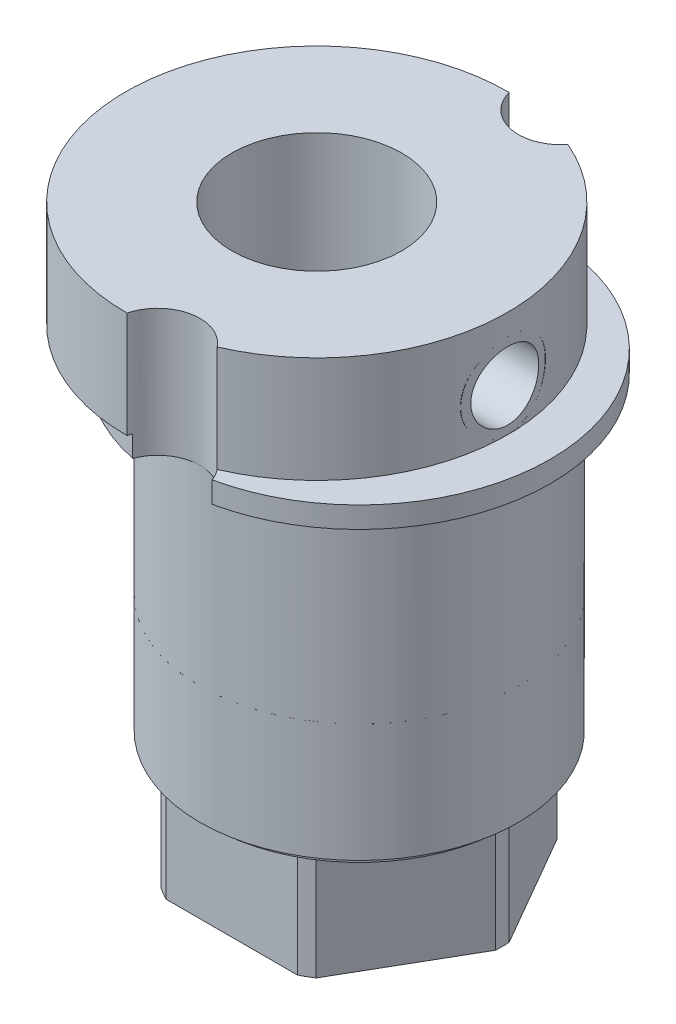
ISO-10303-21;
HEADER;
FILE_DESCRIPTION(('STEP AP214'),'2;1');
FILE_NAME('part.step','',(''),(''),'','','');
FILE_SCHEMA(('AUTOMOTIVE_DESIGN { 1 0 10303 214 1 1 1 1 }'));
ENDSEC;
DATA;
#1=APPLICATION_CONTEXT('core data for automotive mechanical design processes');
#2=APPLICATION_PROTOCOL_DEFINITION('international standard','automotive_design',2000,#1);
#3=PRODUCT_CONTEXT('',#1,'mechanical');
#4=PRODUCT('Part','Part','',(#3));
#5=PRODUCT_RELATED_PRODUCT_CATEGORY('part','',(#4));
#6=PRODUCT_DEFINITION_FORMATION('','',#4);
#7=PRODUCT_DEFINITION_CONTEXT('part definition',#1,'design');
#8=PRODUCT_DEFINITION('design','',#6,#7);
#9=PRODUCT_DEFINITION_SHAPE('','',#8);
#10=(LENGTH_UNIT() NAMED_UNIT(*) SI_UNIT(.MILLI.,.METRE.));
#11=(NAMED_UNIT(*) PLANE_ANGLE_UNIT() SI_UNIT($,.RADIAN.));
#12=(NAMED_UNIT(*) SI_UNIT($,.STERADIAN.) SOLID_ANGLE_UNIT());
#13=UNCERTAINTY_MEASURE_WITH_UNIT(LENGTH_MEASURE(1.E-05),#10,'distance_accuracy_value','');
#14=(GEOMETRIC_REPRESENTATION_CONTEXT(3) GLOBAL_UNCERTAINTY_ASSIGNED_CONTEXT((#13)) GLOBAL_UNIT_ASSIGNED_CONTEXT((#10,
#11,#12)) REPRESENTATION_CONTEXT('',''));
#15=CARTESIAN_POINT('',(0.,0.,0.));
#16=DIRECTION('',(0.,0.,1.));
#17=DIRECTION('',(1.,0.,0.));
#18=AXIS2_PLACEMENT_3D('',#15,#16,#17);
#19=CARTESIAN_POINT('',(2.,-11.05,0.));
#20=DIRECTION('',(0.,1.,0.));
#21=DIRECTION('',(0.,0.,1.));
#22=AXIS2_PLACEMENT_3D('',#19,#20,#21);
#23=CYLINDRICAL_SURFACE('',#22,6.75);
#24=CARTESIAN_POINT('',(2.,-5.,0.));
#25=DIRECTION('',(0.,1.,0.));
#26=DIRECTION('',(0.,0.,1.));
#27=AXIS2_PLACEMENT_3D('',#24,#25,#26);
#28=CIRCLE('',#27,6.75);
#29=CARTESIAN_POINT('',(-1.6499878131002,-5.,-5.67803566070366));
#30=VERTEX_POINT('',#29);
#31=CARTESIAN_POINT('',(-1.09232921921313,-5.0000000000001,-6.));
#32=VERTEX_POINT('',#31);
#33=EDGE_CURVE('P0_E200',#30,#32,#28,.F.);
#34=ORIENTED_EDGE('',*,*,#33,.T.);
#35=DIRECTION('',(0.,1.,0.));
#36=VECTOR('',#35,1.);
#37=CARTESIAN_POINT('',(-1.092329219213,-10.,-6.));
#38=LINE('',#37,#36);
#39=CARTESIAN_POINT('',(-1.09232921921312,-10.,-6.));
#40=VERTEX_POINT('',#39);
#41=EDGE_CURVE('P0_E175',#32,#40,#38,.F.);
#42=ORIENTED_EDGE('',*,*,#41,.T.);
#43=CARTESIAN_POINT('',(2.,-10.,0.));
#44=DIRECTION('',(0.,1.,0.));
#45=DIRECTION('',(0.,0.,1.));
#46=AXIS2_PLACEMENT_3D('',#43,#44,#45);
#47=CIRCLE('',#46,6.75);
#48=CARTESIAN_POINT('',(-1.64998781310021,-10.,-5.67803566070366));
#49=VERTEX_POINT('',#48);
#50=EDGE_CURVE('P0_E441',#49,#40,#47,.F.);
#51=ORIENTED_EDGE('',*,*,#50,.F.);
#52=DIRECTION('',(0.,1.,0.));
#53=VECTOR('',#52,1.);
#54=CARTESIAN_POINT('',(-1.64998781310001,-10.,-5.67803566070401));
#55=LINE('',#54,#53);
#56=EDGE_CURVE('P0_E166',#49,#30,#55,.T.);
#57=ORIENTED_EDGE('',*,*,#56,.T.);
#58=EDGE_LOOP('',(#34,#42,#51,#57));
#59=FACE_BOUND('',#58,.T.);
#60=ADVANCED_FACE('P0_F16',(#59),#23,.T.);
#61=CARTESIAN_POINT('',(2.,-11.05,0.));
#62=DIRECTION('',(0.,1.,0.));
#63=DIRECTION('',(0.,0.,1.));
#64=AXIS2_PLACEMENT_3D('',#61,#62,#63);
#65=CYLINDRICAL_SURFACE('',#64,6.75);
#66=CARTESIAN_POINT('',(2.,-5.,0.));
#67=DIRECTION('',(0.,1.,0.));
#68=DIRECTION('',(0.,0.,1.));
#69=AXIS2_PLACEMENT_3D('',#66,#67,#68);
#70=CIRCLE('',#69,6.75);
#71=CARTESIAN_POINT('',(5.09232921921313,-5.0000000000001,-6.));
#72=VERTEX_POINT('',#71);
#73=CARTESIAN_POINT('',(5.64998781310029,-5.00000000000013,-5.67803566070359));
#74=VERTEX_POINT('',#73);
#75=EDGE_CURVE('P0_E195',#72,#74,#70,.F.);
#76=ORIENTED_EDGE('',*,*,#75,.T.);
#77=DIRECTION('',(0.,1.,0.));
#78=VECTOR('',#77,1.);
#79=CARTESIAN_POINT('',(5.64998781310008,-10.,-5.67803566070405));
#80=LINE('',#79,#78);
#81=CARTESIAN_POINT('',(5.64998781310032,-10.,-5.67803566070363));
#82=VERTEX_POINT('',#81);
#83=EDGE_CURVE('P0_E158',#74,#82,#80,.F.);
#84=ORIENTED_EDGE('',*,*,#83,.T.);
#85=CARTESIAN_POINT('',(2.,-10.,0.));
#86=DIRECTION('',(0.,1.,0.));
#87=DIRECTION('',(0.,0.,1.));
#88=AXIS2_PLACEMENT_3D('',#85,#86,#87);
#89=CIRCLE('',#88,6.75);
#90=CARTESIAN_POINT('',(5.09232921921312,-10.,-6.));
#91=VERTEX_POINT('',#90);
#92=EDGE_CURVE('P0_E148',#91,#82,#89,.F.);
#93=ORIENTED_EDGE('',*,*,#92,.F.);
#94=DIRECTION('',(0.,1.,0.));
#95=VECTOR('',#94,1.);
#96=CARTESIAN_POINT('',(5.092329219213,-10.,-6.));
#97=LINE('',#96,#95);
#98=EDGE_CURVE('P0_E172',#91,#72,#97,.T.);
#99=ORIENTED_EDGE('',*,*,#98,.T.);
#100=EDGE_LOOP('',(#76,#84,#93,#99));
#101=FACE_BOUND('',#100,.T.);
#102=ADVANCED_FACE('P0_F453',(#101),#65,.T.);
#103=CARTESIAN_POINT('',(2.,-11.05,0.));
#104=DIRECTION('',(0.,1.,0.));
#105=DIRECTION('',(0.,0.,1.));
#106=AXIS2_PLACEMENT_3D('',#103,#104,#105);
#107=CYLINDRICAL_SURFACE('',#106,6.75);
#108=CARTESIAN_POINT('',(2.,-5.,0.));
#109=DIRECTION('',(0.,1.,0.));
#110=DIRECTION('',(0.,0.,1.));
#111=AXIS2_PLACEMENT_3D('',#108,#109,#110);
#112=CIRCLE('',#111,6.75);
#113=CARTESIAN_POINT('',(5.6499878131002,-5.,5.67803566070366));
#114=VERTEX_POINT('',#113);
#115=CARTESIAN_POINT('',(5.09232921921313,-5.0000000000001,6.));
#116=VERTEX_POINT('',#115);
#117=EDGE_CURVE('P0_E187',#114,#116,#112,.F.);
#118=ORIENTED_EDGE('',*,*,#117,.T.);
#119=DIRECTION('',(0.,1.,0.));
#120=VECTOR('',#119,1.);
#121=CARTESIAN_POINT('',(5.092329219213,-10.,6.));
#122=LINE('',#121,#120);
#123=CARTESIAN_POINT('',(5.09232921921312,-10.,6.));
#124=VERTEX_POINT('',#123);
#125=EDGE_CURVE('P0_E163',#116,#124,#122,.F.);
#126=ORIENTED_EDGE('',*,*,#125,.T.);
#127=CARTESIAN_POINT('',(2.,-10.,0.));
#128=DIRECTION('',(0.,1.,0.));
#129=DIRECTION('',(0.,0.,1.));
#130=AXIS2_PLACEMENT_3D('',#127,#128,#129);
#131=CIRCLE('',#130,6.75);
#132=CARTESIAN_POINT('',(5.64998781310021,-10.,5.67803566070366));
#133=VERTEX_POINT('',#132);
#134=EDGE_CURVE('P0_E142',#133,#124,#131,.F.);
#135=ORIENTED_EDGE('',*,*,#134,.F.);
#136=DIRECTION('',(0.,1.,0.));
#137=VECTOR('',#136,1.);
#138=CARTESIAN_POINT('',(5.64998781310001,-10.,5.67803566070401));
#139=LINE('',#138,#137);
#140=EDGE_CURVE('P0_E192',#133,#114,#139,.T.);
#141=ORIENTED_EDGE('',*,*,#140,.T.);
#142=EDGE_LOOP('',(#118,#126,#135,#141));
#143=FACE_BOUND('',#142,.T.);
#144=ADVANCED_FACE('P0_F427',(#143),#107,.T.);
#145=CARTESIAN_POINT('',(2.,-11.05,0.));
#146=DIRECTION('',(0.,1.,0.));
#147=DIRECTION('',(0.,0.,1.));
#148=AXIS2_PLACEMENT_3D('',#145,#146,#147);
#149=CYLINDRICAL_SURFACE('',#148,6.75);
#150=DIRECTION('',(0.,1.,0.));
#151=VECTOR('',#150,1.);
#152=CARTESIAN_POINT('',(8.7423170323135,-10.,0.321964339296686));
#153=LINE('',#152,#151);
#154=CARTESIAN_POINT('',(8.74231703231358,-5.,0.321964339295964));
#155=VERTEX_POINT('',#154);
#156=CARTESIAN_POINT('',(8.74231703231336,-10.,0.321964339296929));
#157=VERTEX_POINT('',#156);
#158=EDGE_CURVE('P0_E138',#155,#157,#153,.F.);
#159=ORIENTED_EDGE('',*,*,#158,.T.);
#160=CARTESIAN_POINT('',(2.,-10.,0.));
#161=DIRECTION('',(0.,1.,0.));
#162=DIRECTION('',(0.,0.,1.));
#163=AXIS2_PLACEMENT_3D('',#160,#161,#162);
#164=CIRCLE('',#163,6.75);
#165=CARTESIAN_POINT('',(8.74231703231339,-10.,-0.321964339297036));
#166=VERTEX_POINT('',#165);
#167=EDGE_CURVE('P0_E19',#166,#157,#164,.F.);
#168=ORIENTED_EDGE('',*,*,#167,.F.);
#169=DIRECTION('',(0.,1.,0.));
#170=VECTOR('',#169,1.);
#171=CARTESIAN_POINT('',(8.74231703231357,-10.,-0.321964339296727));
#172=LINE('',#171,#170);
#173=CARTESIAN_POINT('',(8.74231703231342,-5.00000000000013,-0.321964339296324));
#174=VERTEX_POINT('',#173);
#175=EDGE_CURVE('P0_E135',#166,#174,#172,.T.);
#176=ORIENTED_EDGE('',*,*,#175,.T.);
#177=CARTESIAN_POINT('',(2.,-5.,0.));
#178=DIRECTION('',(0.,1.,0.));
#179=DIRECTION('',(0.,0.,1.));
#180=AXIS2_PLACEMENT_3D('',#177,#178,#179);
#181=CIRCLE('',#180,6.75);
#182=EDGE_CURVE('P0_E143',#174,#155,#181,.F.);
#183=ORIENTED_EDGE('',*,*,#182,.T.);
#184=EDGE_LOOP('',(#159,#168,#176,#183));
#185=FACE_BOUND('',#184,.T.);
#186=ADVANCED_FACE('P0_F132',(#185),#149,.T.);
#187=CARTESIAN_POINT('',(0.,-10.,0.));
#188=DIRECTION('',(0.,-1.,0.));
#189=DIRECTION('',(0.,0.,-1.));
#190=AXIS2_PLACEMENT_3D('',#187,#188,#189);
#191=PLANE('',#190);
#192=CARTESIAN_POINT('',(0.,-10.,0.));
#193=DIRECTION('',(0.,-1.,0.));
#194=DIRECTION('',(0.,0.,-1.));
#195=AXIS2_PLACEMENT_3D('',#192,#193,#194);
#196=CIRCLE('',#195,4.);
#197=CARTESIAN_POINT('',(0.,-10.,-4.));
#198=VERTEX_POINT('',#197);
#199=EDGE_CURVE('P0_E160',#198,#198,#196,.F.);
#200=ORIENTED_EDGE('',*,*,#199,.T.);
#201=EDGE_LOOP('',(#200));
#202=FACE_BOUND('',#201,.T.);
#203=ORIENTED_EDGE('',*,*,#92,.T.);
#204=DIRECTION('',(0.500000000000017,0.,0.866025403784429));
#205=VECTOR('',#204,1.);
#206=CARTESIAN_POINT('',(8.928203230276,-10.,0.));
#207=LINE('',#206,#205);
#208=EDGE_CURVE('P0_E145',#82,#166,#207,.T.);
#209=ORIENTED_EDGE('',*,*,#208,.T.);
#210=ORIENTED_EDGE('',*,*,#167,.T.);
#211=DIRECTION('',(-0.500000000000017,0.,0.866025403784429));
#212=VECTOR('',#211,1.);
#213=CARTESIAN_POINT('',(5.464101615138,-10.,6.));
#214=LINE('',#213,#212);
#215=EDGE_CURVE('P0_E190',#157,#133,#214,.T.);
#216=ORIENTED_EDGE('',*,*,#215,.T.);
#217=ORIENTED_EDGE('',*,*,#134,.T.);
#218=DIRECTION('',(-1.,0.,0.));
#219=VECTOR('',#218,1.);
#220=CARTESIAN_POINT('',(-1.464101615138,-10.,6.));
#221=LINE('',#220,#219);
#222=CARTESIAN_POINT('',(-1.09232921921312,-10.,6.));
#223=VERTEX_POINT('',#222);
#224=EDGE_CURVE('P0_E196',#124,#223,#221,.T.);
#225=ORIENTED_EDGE('',*,*,#224,.T.);
#226=CARTESIAN_POINT('',(2.,-10.,0.));
#227=DIRECTION('',(0.,1.,0.));
#228=DIRECTION('',(0.,0.,1.));
#229=AXIS2_PLACEMENT_3D('',#226,#227,#228);
#230=CIRCLE('',#229,6.75);
#231=CARTESIAN_POINT('',(-1.64998781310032,-10.,5.67803566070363));
#232=VERTEX_POINT('',#231);
#233=EDGE_CURVE('P0_E182',#232,#223,#230,.T.);
#234=ORIENTED_EDGE('',*,*,#233,.F.);
#235=DIRECTION('',(-0.500000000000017,0.,-0.866025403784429));
#236=VECTOR('',#235,1.);
#237=CARTESIAN_POINT('',(-4.928203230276,-10.,0.));
#238=LINE('',#237,#236);
#239=CARTESIAN_POINT('',(-4.74231703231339,-10.,0.321964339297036));
#240=VERTEX_POINT('',#239);
#241=EDGE_CURVE('P0_E183',#232,#240,#238,.T.);
#242=ORIENTED_EDGE('',*,*,#241,.T.);
#243=CARTESIAN_POINT('',(2.,-10.,0.));
#244=DIRECTION('',(0.,1.,0.));
#245=DIRECTION('',(0.,0.,1.));
#246=AXIS2_PLACEMENT_3D('',#243,#244,#245);
#247=CIRCLE('',#246,6.75);
#248=CARTESIAN_POINT('',(-4.74231703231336,-10.,-0.321964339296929));
#249=VERTEX_POINT('',#248);
#250=EDGE_CURVE('P0_E204',#249,#240,#247,.T.);
#251=ORIENTED_EDGE('',*,*,#250,.F.);
#252=DIRECTION('',(0.500000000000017,0.,-0.866025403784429));
#253=VECTOR('',#252,1.);
#254=CARTESIAN_POINT('',(-1.464101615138,-10.,-6.));
#255=LINE('',#254,#253);
#256=EDGE_CURVE('P0_E169',#249,#49,#255,.T.);
#257=ORIENTED_EDGE('',*,*,#256,.T.);
#258=ORIENTED_EDGE('',*,*,#50,.T.);
#259=DIRECTION('',(1.,0.,0.));
#260=VECTOR('',#259,1.);
#261=CARTESIAN_POINT('',(5.464101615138,-10.,-6.));
#262=LINE('',#261,#260);
#263=EDGE_CURVE('P0_E176',#40,#91,#262,.T.);
#264=ORIENTED_EDGE('',*,*,#263,.T.);
#265=EDGE_LOOP('',(#203,#209,#210,#216,#217,#225,#234,#242,#251,#257,#258,#264));
#266=FACE_BOUND('',#265,.T.);
#267=ADVANCED_FACE('P0_F146',(#202,#266),#191,.T.);
#268=CARTESIAN_POINT('',(2.,-11.05,0.));
#269=DIRECTION('',(0.,1.,0.));
#270=DIRECTION('',(0.,0.,1.));
#271=AXIS2_PLACEMENT_3D('',#268,#269,#270);
#272=CYLINDRICAL_SURFACE('',#271,6.75);
#273=DIRECTION('',(0.,1.,0.));
#274=VECTOR('',#273,1.);
#275=CARTESIAN_POINT('',(-4.74231703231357,-10.,0.321964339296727));
#276=LINE('',#275,#274);
#277=CARTESIAN_POINT('',(-4.74231703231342,-5.00000000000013,0.321964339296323));
#278=VERTEX_POINT('',#277);
#279=EDGE_CURVE('P0_E185',#240,#278,#276,.T.);
#280=ORIENTED_EDGE('',*,*,#279,.T.);
#281=CARTESIAN_POINT('',(2.,-5.,0.));
#282=DIRECTION('',(0.,1.,0.));
#283=DIRECTION('',(0.,0.,1.));
#284=AXIS2_PLACEMENT_3D('',#281,#282,#283);
#285=CIRCLE('',#284,6.75);
#286=CARTESIAN_POINT('',(-4.74231703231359,-5.,-0.321964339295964));
#287=VERTEX_POINT('',#286);
#288=EDGE_CURVE('P0_E202',#278,#287,#285,.F.);
#289=ORIENTED_EDGE('',*,*,#288,.T.);
#290=DIRECTION('',(0.,1.,0.));
#291=VECTOR('',#290,1.);
#292=CARTESIAN_POINT('',(-4.7423170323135,-10.,-0.321964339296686));
#293=LINE('',#292,#291);
#294=EDGE_CURVE('P0_E152',#287,#249,#293,.F.);
#295=ORIENTED_EDGE('',*,*,#294,.T.);
#296=ORIENTED_EDGE('',*,*,#250,.T.);
#297=EDGE_LOOP('',(#280,#289,#295,#296));
#298=FACE_BOUND('',#297,.T.);
#299=ADVANCED_FACE('P0_F499',(#298),#272,.T.);
#300=CARTESIAN_POINT('',(2.,-11.05,0.));
#301=DIRECTION('',(0.,1.,0.));
#302=DIRECTION('',(0.,0.,1.));
#303=AXIS2_PLACEMENT_3D('',#300,#301,#302);
#304=CYLINDRICAL_SURFACE('',#303,6.75);
#305=CARTESIAN_POINT('',(2.,-5.,0.));
#306=DIRECTION('',(0.,1.,0.));
#307=DIRECTION('',(0.,0.,1.));
#308=AXIS2_PLACEMENT_3D('',#305,#306,#307);
#309=CIRCLE('',#308,6.75);
#310=CARTESIAN_POINT('',(-1.09232921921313,-5.0000000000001,6.));
#311=VERTEX_POINT('',#310);
#312=CARTESIAN_POINT('',(-1.64998781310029,-5.00000000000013,5.67803566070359));
#313=VERTEX_POINT('',#312);
#314=EDGE_CURVE('P0_E179',#311,#313,#309,.F.);
#315=ORIENTED_EDGE('',*,*,#314,.T.);
#316=DIRECTION('',(0.,1.,0.));
#317=VECTOR('',#316,1.);
#318=CARTESIAN_POINT('',(-1.64998781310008,-10.,5.67803566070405));
#319=LINE('',#318,#317);
#320=EDGE_CURVE('P0_E410',#313,#232,#319,.F.);
#321=ORIENTED_EDGE('',*,*,#320,.T.);
#322=ORIENTED_EDGE('',*,*,#233,.T.);
#323=DIRECTION('',(0.,1.,0.));
#324=VECTOR('',#323,1.);
#325=CARTESIAN_POINT('',(-1.092329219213,-10.,6.));
#326=LINE('',#325,#324);
#327=EDGE_CURVE('P0_E198',#223,#311,#326,.T.);
#328=ORIENTED_EDGE('',*,*,#327,.T.);
#329=EDGE_LOOP('',(#315,#321,#322,#328));
#330=FACE_BOUND('',#329,.T.);
#331=ADVANCED_FACE('P0_F431',(#330),#304,.T.);
#332=CARTESIAN_POINT('',(5.464101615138,-10.,-6.));
#333=DIRECTION('',(0.,0.,1.));
#334=DIRECTION('',(1.,0.,0.));
#335=AXIS2_PLACEMENT_3D('',#332,#333,#334);
#336=PLANE('',#335);
#337=DIRECTION('',(1.,0.,0.));
#338=VECTOR('',#337,1.);
#339=CARTESIAN_POINT('',(0.,-5.,-6.));
#340=LINE('',#339,#338);
#341=EDGE_CURVE('P0_E407',#72,#32,#340,.F.);
#342=ORIENTED_EDGE('',*,*,#341,.F.);
#343=ORIENTED_EDGE('',*,*,#98,.F.);
#344=ORIENTED_EDGE('',*,*,#263,.F.);
#345=ORIENTED_EDGE('',*,*,#41,.F.);
#346=EDGE_LOOP('',(#342,#343,#344,#345));
#347=FACE_BOUND('',#346,.T.);
#348=ADVANCED_FACE('P0_F450',(#347),#336,.F.);
#349=CARTESIAN_POINT('',(-1.464101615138,-10.,-6.));
#350=DIRECTION('',(0.866025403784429,0.,0.500000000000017));
#351=DIRECTION('',(0.500000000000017,0.,-0.866025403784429));
#352=AXIS2_PLACEMENT_3D('',#349,#350,#351);
#353=PLANE('',#352);
#354=DIRECTION('',(-0.499999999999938,0.,0.866025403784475));
#355=VECTOR('',#354,1.);
#356=CARTESIAN_POINT('',(-1.6499878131,-5.,-5.678035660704));
#357=LINE('',#356,#355);
#358=EDGE_CURVE('P0_E404',#30,#287,#357,.T.);
#359=ORIENTED_EDGE('',*,*,#358,.F.);
#360=ORIENTED_EDGE('',*,*,#56,.F.);
#361=ORIENTED_EDGE('',*,*,#256,.F.);
#362=ORIENTED_EDGE('',*,*,#294,.F.);
#363=EDGE_LOOP('',(#359,#360,#361,#362));
#364=FACE_BOUND('',#363,.T.);
#365=ADVANCED_FACE('P0_F503',(#364),#353,.F.);
#366=CARTESIAN_POINT('',(8.928203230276,-10.,0.));
#367=DIRECTION('',(-0.866025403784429,0.,0.500000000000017));
#368=DIRECTION('',(0.500000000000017,0.,0.866025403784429));
#369=AXIS2_PLACEMENT_3D('',#366,#367,#368);
#370=PLANE('',#369);
#371=DIRECTION('',(-0.499999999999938,0.,-0.866025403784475));
#372=VECTOR('',#371,1.);
#373=CARTESIAN_POINT('',(8.742317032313,-5.,-0.3219643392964));
#374=LINE('',#373,#372);
#375=EDGE_CURVE('P0_E156',#174,#74,#374,.T.);
#376=ORIENTED_EDGE('',*,*,#375,.F.);
#377=ORIENTED_EDGE('',*,*,#175,.F.);
#378=ORIENTED_EDGE('',*,*,#208,.F.);
#379=ORIENTED_EDGE('',*,*,#83,.F.);
#380=EDGE_LOOP('',(#376,#377,#378,#379));
#381=FACE_BOUND('',#380,.T.);
#382=ADVANCED_FACE('P0_F154',(#381),#370,.F.);
#383=CARTESIAN_POINT('',(0.,17.3,0.));
#384=DIRECTION('',(0.,-1.,0.));
#385=DIRECTION('',(0.,0.,-1.));
#386=AXIS2_PLACEMENT_3D('',#383,#384,#385);
#387=CYLINDRICAL_SURFACE('',#386,4.);
#388=ORIENTED_EDGE('',*,*,#199,.F.);
#389=EDGE_LOOP('',(#388));
#390=FACE_BOUND('',#389,.T.);
#391=CARTESIAN_POINT('',(0.,16.,0.));
#392=DIRECTION('',(0.,-1.,0.));
#393=DIRECTION('',(0.,0.,-1.));
#394=AXIS2_PLACEMENT_3D('',#391,#392,#393);
#395=CIRCLE('',#394,4.);
#396=CARTESIAN_POINT('',(0.,16.,-4.));
#397=VERTEX_POINT('',#396);
#398=EDGE_CURVE('P0_E745',#397,#397,#395,.F.);
#399=ORIENTED_EDGE('',*,*,#398,.T.);
#400=EDGE_LOOP('',(#399));
#401=FACE_BOUND('',#400,.T.);
#402=CARTESIAN_POINT('',(4.,14.6,0.));
#403=CARTESIAN_POINT('',(3.99999603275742,14.5999949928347,0.0860926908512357));
#404=CARTESIAN_POINT('',(3.99719117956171,14.5930175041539,0.17226055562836));
#405=CARTESIAN_POINT('',(3.98625670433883,14.5653745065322,0.342093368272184));
#406=CARTESIAN_POINT('',(3.9781194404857,14.5446893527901,0.425754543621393));
#407=CARTESIAN_POINT('',(3.95739553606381,14.4905038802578,0.587952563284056));
#408=CARTESIAN_POINT('',(3.94482134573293,14.4570393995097,0.666503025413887));
#409=CARTESIAN_POINT('',(3.91645813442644,14.3783997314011,0.816832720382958));
#410=CARTESIAN_POINT('',(3.90066915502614,14.3332246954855,0.888612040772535));
#411=CARTESIAN_POINT('',(3.86664641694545,14.2302095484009,1.02680381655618));
#412=CARTESIAN_POINT('',(3.84833694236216,14.1719101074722,1.09285505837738));
#413=CARTESIAN_POINT('',(3.81168317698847,14.0452746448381,1.21454429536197));
#414=CARTESIAN_POINT('',(3.79333887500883,13.9769345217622,1.27017801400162));
#415=CARTESIAN_POINT('',(3.75778246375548,13.8284580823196,1.3718993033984));
#416=CARTESIAN_POINT('',(3.74065716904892,13.7479319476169,1.41745134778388));
#417=CARTESIAN_POINT('',(3.71066935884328,13.5795721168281,1.49420333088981));
#418=CARTESIAN_POINT('',(3.69780487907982,13.4917418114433,1.52540988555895));
#419=CARTESIAN_POINT('',(3.67861086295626,13.3154301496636,1.57111905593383));
#420=CARTESIAN_POINT('',(3.67201136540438,13.2271590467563,1.58631516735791));
#421=CARTESIAN_POINT('',(3.66531203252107,13.0490920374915,1.60173836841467));
#422=CARTESIAN_POINT('',(3.66520900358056,12.9592969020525,1.60197281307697));
#423=CARTESIAN_POINT('',(3.6712840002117,12.7873947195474,1.58799149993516));
#424=CARTESIAN_POINT('',(3.67702539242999,12.7051875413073,1.57478027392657));
#425=CARTESIAN_POINT('',(3.69340948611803,12.5442724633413,1.53595753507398));
#426=CARTESIAN_POINT('',(3.70405304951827,12.4655651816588,1.51034384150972));
#427=CARTESIAN_POINT('',(3.72927613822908,12.3119841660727,1.4469551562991));
#428=CARTESIAN_POINT('',(3.74393162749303,12.2372215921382,1.4089424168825));
#429=CARTESIAN_POINT('',(3.77550561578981,12.0948646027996,1.32200312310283));
#430=CARTESIAN_POINT('',(3.79242487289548,12.0272726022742,1.27307290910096));
#431=CARTESIAN_POINT('',(3.82821125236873,11.8956819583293,1.16124899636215));
#432=CARTESIAN_POINT('',(3.84712793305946,11.8323631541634,1.09756911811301));
#433=CARTESIAN_POINT('',(3.88367355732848,11.7170671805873,0.960271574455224));
#434=CARTESIAN_POINT('',(3.90130187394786,11.6650955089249,0.886649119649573));
#435=CARTESIAN_POINT('',(3.9337298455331,11.573071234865,0.729605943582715));
#436=CARTESIAN_POINT('',(3.94846452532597,11.5332831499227,0.646016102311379));
#437=CARTESIAN_POINT('',(3.9729333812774,11.468626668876,0.472668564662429));
#438=CARTESIAN_POINT('',(3.98267758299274,11.4437283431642,0.382923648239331));
#439=CARTESIAN_POINT('',(3.99286853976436,11.4178949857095,0.243589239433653));
#440=CARTESIAN_POINT('',(3.99553303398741,11.4111951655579,0.195161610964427));
#441=CARTESIAN_POINT('',(3.99909988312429,11.4022462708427,0.0978307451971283));
#442=CARTESIAN_POINT('',(4.0000022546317,11.3999971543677,0.048927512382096));
#443=CARTESIAN_POINT('',(3.99999603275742,11.4000050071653,-0.0860926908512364));
#444=CARTESIAN_POINT('',(3.99719117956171,11.4069824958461,-0.17226055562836));
#445=CARTESIAN_POINT('',(3.98625670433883,11.4346254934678,-0.342093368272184));
#446=CARTESIAN_POINT('',(3.9781194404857,11.4553106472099,-0.425754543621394));
#447=CARTESIAN_POINT('',(3.95739553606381,11.5094961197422,-0.587952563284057));
#448=CARTESIAN_POINT('',(3.94482134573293,11.5429606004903,-0.666503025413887));
#449=CARTESIAN_POINT('',(3.91645813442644,11.6216002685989,-0.816832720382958));
#450=CARTESIAN_POINT('',(3.90066915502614,11.6667753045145,-0.888612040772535));
#451=CARTESIAN_POINT('',(3.86664641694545,11.7697904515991,-1.02680381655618));
#452=CARTESIAN_POINT('',(3.84833694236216,11.8280898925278,-1.09285505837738));
#453=CARTESIAN_POINT('',(3.81168317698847,11.9547253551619,-1.21454429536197));
#454=CARTESIAN_POINT('',(3.79333887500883,12.0230654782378,-1.27017801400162));
#455=CARTESIAN_POINT('',(3.75778246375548,12.1715419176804,-1.3718993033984));
#456=CARTESIAN_POINT('',(3.74065716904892,12.2520680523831,-1.41745134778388));
#457=CARTESIAN_POINT('',(3.71066935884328,12.4204278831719,-1.49420333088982));
#458=CARTESIAN_POINT('',(3.69780487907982,12.5082581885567,-1.52540988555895));
#459=CARTESIAN_POINT('',(3.67861086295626,12.6845698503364,-1.57111905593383));
#460=CARTESIAN_POINT('',(3.67201136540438,12.7728409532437,-1.58631516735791));
#461=CARTESIAN_POINT('',(3.66531203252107,12.9509079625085,-1.60173836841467));
#462=CARTESIAN_POINT('',(3.66520900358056,13.0407030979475,-1.60197281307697));
#463=CARTESIAN_POINT('',(3.6712840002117,13.2126052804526,-1.58799149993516));
#464=CARTESIAN_POINT('',(3.67702539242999,13.2948124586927,-1.57478027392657));
#465=CARTESIAN_POINT('',(3.69340948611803,13.4557275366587,-1.53595753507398));
#466=CARTESIAN_POINT('',(3.70405304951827,13.5344348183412,-1.51034384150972));
#467=CARTESIAN_POINT('',(3.72927613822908,13.6880158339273,-1.4469551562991));
#468=CARTESIAN_POINT('',(3.74393162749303,13.7627784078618,-1.4089424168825));
#469=CARTESIAN_POINT('',(3.77550561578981,13.9051353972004,-1.32200312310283));
#470=CARTESIAN_POINT('',(3.79242487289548,13.9727273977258,-1.27307290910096));
#471=CARTESIAN_POINT('',(3.82821125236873,14.1043180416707,-1.16124899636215));
#472=CARTESIAN_POINT('',(3.84712793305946,14.1676368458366,-1.09756911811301));
#473=CARTESIAN_POINT('',(3.88367355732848,14.2829328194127,-0.960271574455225));
#474=CARTESIAN_POINT('',(3.90130187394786,14.3349044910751,-0.886649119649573));
#475=CARTESIAN_POINT('',(3.9337298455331,14.426928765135,-0.729605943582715));
#476=CARTESIAN_POINT('',(3.94846452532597,14.4667168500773,-0.646016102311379));
#477=CARTESIAN_POINT('',(3.9729333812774,14.531373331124,-0.472668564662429));
#478=CARTESIAN_POINT('',(3.98267758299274,14.5562716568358,-0.382923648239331));
#479=CARTESIAN_POINT('',(3.99286853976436,14.5821050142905,-0.243589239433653));
#480=CARTESIAN_POINT('',(3.99553303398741,14.5888048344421,-0.195161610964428));
#481=CARTESIAN_POINT('',(3.99909988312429,14.5977537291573,-0.0978307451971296));
#482=CARTESIAN_POINT('',(4.0000022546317,14.6000028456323,-0.048927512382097));
#483=CARTESIAN_POINT('',(4.,14.6,0.));
#484=B_SPLINE_CURVE_WITH_KNOTS('',3,(#402,#403,#404,#405,#406,#407,#408,#409,#410,#411,#412,
#413,#414,#415,#416,#417,#418,#419,#420,#421,#422,#423,#424,#425,#426,#427,#428,#429,#430,#431,
#432,#433,#434,#435,#436,#437,#438,#439,#440,#441,#442,#443,#444,#445,#446,#447,#448,#449,#450,
#451,#452,#453,#454,#455,#456,#457,#458,#459,#460,#461,#462,#463,#464,#465,#466,#467,#468,#469,
#470,#471,#472,#473,#474,#475,#476,#477,#478,#479,#480,#481,#482,#483),.UNSPECIFIED.,.T.,.F.,(4,
2,2,2,2,2,2,2,2,2,2,2,2,2,2,2,2,2,2,2,2,2,2,2,2,2,2,2,2,2,2,2,2,2,2,2,2,2,2,2,4),(0.,
0.258088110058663,0.516546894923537,0.774286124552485,1.03202202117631,1.30078954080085,
1.56966715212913,1.85052009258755,2.13124337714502,2.39923278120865,2.66709044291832,
2.91630644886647,3.16556629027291,3.4199181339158,3.6743553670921,3.94842780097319,
4.22263273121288,4.50242636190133,4.78165567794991,4.92833163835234,5.0750062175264,
5.33309432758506,5.59155311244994,5.84929234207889,6.10702823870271,6.37579575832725,
6.64467336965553,6.92552631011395,7.20624959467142,7.47423899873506,7.74209666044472,
7.99131266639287,8.24057250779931,8.4949243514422,8.7493615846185,9.02343401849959,
9.29763894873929,9.57743257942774,9.85666189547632,10.0033378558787,10.1500124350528),.UNSPECIFIED.);
#485=CARTESIAN_POINT('',(4.,14.6,0.));
#486=VERTEX_POINT('',#485);
#487=EDGE_CURVE('P0_E734',#486,#486,#484,.T.);
#488=ORIENTED_EDGE('',*,*,#487,.T.);
#489=EDGE_LOOP('',(#488));
#490=FACE_BOUND('',#489,.T.);
#491=ADVANCED_FACE('P0_F334',(#390,#401,#490),#387,.F.);
#492=CARTESIAN_POINT('',(14.7,13.,0.));
#493=DIRECTION('',(-1.,0.,0.));
#494=DIRECTION('',(0.,0.,1.));
#495=AXIS2_PLACEMENT_3D('',#492,#493,#494);
#496=CYLINDRICAL_SURFACE('',#495,1.6);
#497=CARTESIAN_POINT('',(9.,11.4,0.));
#498=CARTESIAN_POINT('',(8.99999818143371,11.4000041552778,0.0890310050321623));
#499=CARTESIAN_POINT('',(8.99866402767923,11.4074627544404,0.178174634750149));
#500=CARTESIAN_POINT('',(8.99346660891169,11.4371030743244,0.354023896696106));
#501=CARTESIAN_POINT('',(8.98959825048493,11.4593144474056,0.440724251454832));
#502=CARTESIAN_POINT('',(8.97976581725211,11.517765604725,0.609016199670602));
#503=CARTESIAN_POINT('',(8.97380446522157,11.5539871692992,0.690614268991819));
#504=CARTESIAN_POINT('',(8.9604407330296,11.6393865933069,0.846541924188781));
#505=CARTESIAN_POINT('',(8.95303887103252,11.6885597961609,0.92087410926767));
#506=CARTESIAN_POINT('',(8.93752127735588,11.7990424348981,1.06100837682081));
#507=CARTESIAN_POINT('',(8.9293992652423,11.8604659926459,1.12671980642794));
#508=CARTESIAN_POINT('',(8.91340378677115,11.9934630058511,1.24696493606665));
#509=CARTESIAN_POINT('',(8.90553035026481,12.0650376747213,1.30149729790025));
#510=CARTESIAN_POINT('',(8.89086386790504,12.2169264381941,1.39819769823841));
#511=CARTESIAN_POINT('',(8.88407881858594,12.2972985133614,1.44027598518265));
#512=CARTESIAN_POINT('',(8.87244413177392,12.464110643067,1.51029899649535));
#513=CARTESIAN_POINT('',(8.86759432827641,12.550550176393,1.53824493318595));
#514=CARTESIAN_POINT('',(8.8604413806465,12.7260888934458,1.57892523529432));
#515=CARTESIAN_POINT('',(8.85811219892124,12.8151509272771,1.59181523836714));
#516=CARTESIAN_POINT('',(8.85618559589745,12.9942019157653,1.60250059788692));
#517=CARTESIAN_POINT('',(8.85658795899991,13.0841907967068,1.60029714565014));
#518=CARTESIAN_POINT('',(8.86005523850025,13.2614205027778,1.58098465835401));
#519=CARTESIAN_POINT('',(8.86308870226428,13.34868121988,1.56405169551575));
#520=CARTESIAN_POINT('',(8.87142710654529,13.5191038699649,1.51603743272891));
#521=CARTESIAN_POINT('',(8.87673215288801,13.6022656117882,1.48495547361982));
#522=CARTESIAN_POINT('',(8.88904958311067,13.7626523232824,1.40934915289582));
#523=CARTESIAN_POINT('',(8.89607113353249,13.8398423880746,1.3647523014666));
#524=CARTESIAN_POINT('',(8.91102353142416,13.9857042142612,1.26343711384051));
#525=CARTESIAN_POINT('',(8.91895439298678,14.0543758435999,1.20671858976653));
#526=CARTESIAN_POINT('',(8.93496840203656,14.1822645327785,1.08182709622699));
#527=CARTESIAN_POINT('',(8.94305213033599,14.2413363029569,1.01350534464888));
#528=CARTESIAN_POINT('',(8.9583628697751,14.3472268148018,0.867808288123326));
#529=CARTESIAN_POINT('',(8.9655894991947,14.3940401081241,0.790428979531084));
#530=CARTESIAN_POINT('',(8.97838497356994,14.4740986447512,0.628648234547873));
#531=CARTESIAN_POINT('',(8.98395075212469,14.5073188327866,0.544234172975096));
#532=CARTESIAN_POINT('',(8.99276534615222,14.5590017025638,0.37101359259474));
#533=CARTESIAN_POINT('',(8.99601903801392,14.5774954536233,0.282216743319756));
#534=CARTESIAN_POINT('',(8.99862366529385,14.592242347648,0.160638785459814));
#535=CARTESIAN_POINT('',(8.99913867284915,14.5951490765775,0.128586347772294));
#536=CARTESIAN_POINT('',(8.99982716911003,14.5990286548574,0.0643608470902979));
#537=CARTESIAN_POINT('',(9.00000065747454,14.6000015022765,0.0321877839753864));
#538=CARTESIAN_POINT('',(8.99999818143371,14.5999958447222,-0.0890310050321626));
#539=CARTESIAN_POINT('',(8.99866402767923,14.5925372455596,-0.178174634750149));
#540=CARTESIAN_POINT('',(8.99346660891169,14.5628969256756,-0.354023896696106));
#541=CARTESIAN_POINT('',(8.98959825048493,14.5406855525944,-0.440724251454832));
#542=CARTESIAN_POINT('',(8.97976581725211,14.482234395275,-0.609016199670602));
#543=CARTESIAN_POINT('',(8.97380446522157,14.4460128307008,-0.69061426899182));
#544=CARTESIAN_POINT('',(8.9604407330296,14.3606134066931,-0.846541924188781));
#545=CARTESIAN_POINT('',(8.95303887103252,14.3114402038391,-0.92087410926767));
#546=CARTESIAN_POINT('',(8.93752127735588,14.2009575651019,-1.06100837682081));
#547=CARTESIAN_POINT('',(8.9293992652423,14.1395340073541,-1.12671980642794));
#548=CARTESIAN_POINT('',(8.91340378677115,14.0065369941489,-1.24696493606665));
#549=CARTESIAN_POINT('',(8.90553035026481,13.9349623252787,-1.30149729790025));
#550=CARTESIAN_POINT('',(8.89086386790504,13.7830735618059,-1.39819769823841));
#551=CARTESIAN_POINT('',(8.88407881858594,13.7027014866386,-1.44027598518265));
#552=CARTESIAN_POINT('',(8.87244413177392,13.535889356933,-1.51029899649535));
#553=CARTESIAN_POINT('',(8.86759432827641,13.449449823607,-1.53824493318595));
#554=CARTESIAN_POINT('',(8.8604413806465,13.2739111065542,-1.57892523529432));
#555=CARTESIAN_POINT('',(8.85811219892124,13.1848490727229,-1.59181523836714));
#556=CARTESIAN_POINT('',(8.85618559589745,13.0057980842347,-1.60250059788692));
#557=CARTESIAN_POINT('',(8.85658795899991,12.9158092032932,-1.60029714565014));
#558=CARTESIAN_POINT('',(8.86005523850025,12.7385794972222,-1.58098465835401));
#559=CARTESIAN_POINT('',(8.86308870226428,12.65131878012,-1.56405169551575));
#560=CARTESIAN_POINT('',(8.87142710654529,12.4808961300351,-1.51603743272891));
#561=CARTESIAN_POINT('',(8.87673215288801,12.3977343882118,-1.48495547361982));
#562=CARTESIAN_POINT('',(8.88904958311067,12.2373476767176,-1.40934915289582));
#563=CARTESIAN_POINT('',(8.89607113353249,12.1601576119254,-1.3647523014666));
#564=CARTESIAN_POINT('',(8.91102353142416,12.0142957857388,-1.26343711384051));
#565=CARTESIAN_POINT('',(8.91895439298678,11.9456241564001,-1.20671858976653));
#566=CARTESIAN_POINT('',(8.93496840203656,11.8177354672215,-1.08182709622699));
#567=CARTESIAN_POINT('',(8.94305213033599,11.7586636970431,-1.01350534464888));
#568=CARTESIAN_POINT('',(8.9583628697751,11.6527731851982,-0.867808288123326));
#569=CARTESIAN_POINT('',(8.9655894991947,11.6059598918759,-0.790428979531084));
#570=CARTESIAN_POINT('',(8.97838497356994,11.5259013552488,-0.628648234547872));
#571=CARTESIAN_POINT('',(8.98395075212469,11.4926811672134,-0.544234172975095));
#572=CARTESIAN_POINT('',(8.99276534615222,11.4409982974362,-0.371013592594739));
#573=CARTESIAN_POINT('',(8.99601903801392,11.4225045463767,-0.282216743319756));
#574=CARTESIAN_POINT('',(8.99862366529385,11.407757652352,-0.160638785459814));
#575=CARTESIAN_POINT('',(8.99913867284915,11.4048509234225,-0.128586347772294));
#576=CARTESIAN_POINT('',(8.99982716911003,11.4009713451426,-0.0643608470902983));
#577=CARTESIAN_POINT('',(9.00000065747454,11.3999984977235,-0.0321877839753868));
#578=CARTESIAN_POINT('',(9.,11.4,0.));
#579=B_SPLINE_CURVE_WITH_KNOTS('',3,(#497,#498,#499,#500,#501,#502,#503,#504,#505,#506,#507,
#508,#509,#510,#511,#512,#513,#514,#515,#516,#517,#518,#519,#520,#521,#522,#523,#524,#525,#526,
#527,#528,#529,#530,#531,#532,#533,#534,#535,#536,#537,#538,#539,#540,#541,#542,#543,#544,#545,
#546,#547,#548,#549,#550,#551,#552,#553,#554,#555,#556,#557,#558,#559,#560,#561,#562,#563,#564,
#565,#566,#567,#568,#569,#570,#571,#572,#573,#574,#575,#576,#577,#578),.UNSPECIFIED.,.T.,.F.,(4,
2,2,2,2,2,2,2,2,2,2,2,2,2,2,2,2,2,2,2,2,2,2,2,2,2,2,2,2,2,2,2,2,2,2,2,2,2,2,2,4),(0.,
0.266970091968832,0.534478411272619,0.801640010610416,1.06870568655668,1.33838643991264,
1.60809945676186,1.87971133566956,2.1512999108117,2.42005542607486,2.68878972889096,
2.95435513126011,3.21993290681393,3.48696116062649,3.75399355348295,4.02475186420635,
4.2956303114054,4.56700582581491,4.83780727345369,4.93432608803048,5.0308449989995,
5.29781509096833,5.56532341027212,5.83248500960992,6.09955068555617,6.36923143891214,
6.63894445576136,6.91055633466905,7.1821449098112,7.45090042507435,7.71963472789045,
7.9852001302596,8.25077790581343,8.51780615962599,8.78483855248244,9.05559686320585,
9.3264753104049,9.59785082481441,9.86865227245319,9.96517108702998,10.061689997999),.UNSPECIFIED.);
#580=CARTESIAN_POINT('',(9.,11.4,0.));
#581=VERTEX_POINT('',#580);
#582=EDGE_CURVE('P0_E275',#581,#581,#579,.T.);
#583=ORIENTED_EDGE('',*,*,#582,.F.);
#584=EDGE_LOOP('',(#583));
#585=FACE_BOUND('',#584,.T.);
#586=ORIENTED_EDGE('',*,*,#487,.F.);
#587=EDGE_LOOP('',(#586));
#588=FACE_BOUND('',#587,.T.);
#589=ADVANCED_FACE('P0_F284',(#585,#588),#496,.F.);
#590=CARTESIAN_POINT('',(2.,11.,0.));
#591=DIRECTION('',(0.,1.,0.));
#592=DIRECTION('',(0.,0.,1.));
#593=AXIS2_PLACEMENT_3D('',#590,#591,#592);
#594=PLANE('',#593);
#595=CARTESIAN_POINT('',(2.,11.,9.5));
#596=DIRECTION('',(0.,-1.,0.));
#597=DIRECTION('',(0.,0.,-1.));
#598=AXIS2_PLACEMENT_3D('',#595,#596,#597);
#599=CIRCLE('',#598,2.);
#600=CARTESIAN_POINT('',(0.0635663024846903,11.,8.99977551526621));
#601=VERTEX_POINT('',#600);
#602=CARTESIAN_POINT('',(0.125519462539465,11.,8.80263157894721));
#603=VERTEX_POINT('',#602);
#604=EDGE_CURVE('P0_E199',#601,#603,#599,.T.);
#605=ORIENTED_EDGE('',*,*,#604,.F.);
#606=CARTESIAN_POINT('',(0.,11.,0.));
#607=DIRECTION('',(0.,-1.,0.));
#608=DIRECTION('',(0.,0.,-1.));
#609=AXIS2_PLACEMENT_3D('',#606,#607,#608);
#610=CIRCLE('',#609,9.);
#611=CARTESIAN_POINT('',(0.0635663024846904,11.,-8.99977551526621));
#612=VERTEX_POINT('',#611);
#613=EDGE_CURVE('P0_E403',#612,#601,#610,.F.);
#614=ORIENTED_EDGE('',*,*,#613,.F.);
#615=CARTESIAN_POINT('',(2.,11.,-9.5));
#616=DIRECTION('',(0.,-1.,0.));
#617=DIRECTION('',(0.,0.,-1.));
#618=AXIS2_PLACEMENT_3D('',#615,#616,#617);
#619=CIRCLE('',#618,2.);
#620=CARTESIAN_POINT('',(0.125519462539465,11.,-8.80263157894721));
#621=VERTEX_POINT('',#620);
#622=EDGE_CURVE('P0_E739',#621,#612,#619,.T.);
#623=ORIENTED_EDGE('',*,*,#622,.F.);
#624=CARTESIAN_POINT('',(2.,11.,0.));
#625=DIRECTION('',(0.,1.,0.));
#626=DIRECTION('',(0.,0.,1.));
#627=AXIS2_PLACEMENT_3D('',#624,#625,#626);
#628=CIRCLE('',#627,9.);
#629=EDGE_CURVE('P0_E269',#603,#621,#628,.F.);
#630=ORIENTED_EDGE('',*,*,#629,.F.);
#631=EDGE_LOOP('',(#605,#614,#623,#630));
#632=FACE_BOUND('',#631,.T.);
#633=ADVANCED_FACE('P0_F326',(#632),#594,.F.);
#634=CARTESIAN_POINT('',(-1.464101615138,-10.,6.));
#635=DIRECTION('',(0.,0.,-1.));
#636=DIRECTION('',(-1.,0.,0.));
#637=AXIS2_PLACEMENT_3D('',#634,#635,#636);
#638=PLANE('',#637);
#639=DIRECTION('',(1.,0.,0.));
#640=VECTOR('',#639,1.);
#641=CARTESIAN_POINT('',(0.,-5.,6.));
#642=LINE('',#641,#640);
#643=EDGE_CURVE('P0_E272',#311,#116,#642,.T.);
#644=ORIENTED_EDGE('',*,*,#643,.F.);
#645=ORIENTED_EDGE('',*,*,#327,.F.);
#646=ORIENTED_EDGE('',*,*,#224,.F.);
#647=ORIENTED_EDGE('',*,*,#125,.F.);
#648=EDGE_LOOP('',(#644,#645,#646,#647));
#649=FACE_BOUND('',#648,.T.);
#650=ADVANCED_FACE('P0_F323',(#649),#638,.F.);
#651=CARTESIAN_POINT('',(5.464101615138,-10.,6.));
#652=DIRECTION('',(-0.866025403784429,0.,-0.500000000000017));
#653=DIRECTION('',(-0.500000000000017,0.,0.866025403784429));
#654=AXIS2_PLACEMENT_3D('',#651,#652,#653);
#655=PLANE('',#654);
#656=DIRECTION('',(0.499999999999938,0.,-0.866025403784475));
#657=VECTOR('',#656,1.);
#658=CARTESIAN_POINT('',(5.6499878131,-5.,5.678035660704));
#659=LINE('',#658,#657);
#660=EDGE_CURVE('P0_E464',#114,#155,#659,.T.);
#661=ORIENTED_EDGE('',*,*,#660,.F.);
#662=ORIENTED_EDGE('',*,*,#140,.F.);
#663=ORIENTED_EDGE('',*,*,#215,.F.);
#664=ORIENTED_EDGE('',*,*,#158,.F.);
#665=EDGE_LOOP('',(#661,#662,#663,#664));
#666=FACE_BOUND('',#665,.T.);
#667=ADVANCED_FACE('P0_F319',(#666),#655,.F.);
#668=CARTESIAN_POINT('',(-4.928203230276,-10.,0.));
#669=DIRECTION('',(0.866025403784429,0.,-0.500000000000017));
#670=DIRECTION('',(-0.500000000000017,0.,-0.866025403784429));
#671=AXIS2_PLACEMENT_3D('',#668,#669,#670);
#672=PLANE('',#671);
#673=DIRECTION('',(0.499999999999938,0.,0.866025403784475));
#674=VECTOR('',#673,1.);
#675=CARTESIAN_POINT('',(-4.742317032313,-5.,0.3219643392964));
#676=LINE('',#675,#674);
#677=EDGE_CURVE('P0_E268',#278,#313,#676,.T.);
#678=ORIENTED_EDGE('',*,*,#677,.F.);
#679=ORIENTED_EDGE('',*,*,#279,.F.);
#680=ORIENTED_EDGE('',*,*,#241,.F.);
#681=ORIENTED_EDGE('',*,*,#320,.F.);
#682=EDGE_LOOP('',(#678,#679,#680,#681));
#683=FACE_BOUND('',#682,.T.);
#684=ADVANCED_FACE('P0_F315',(#683),#672,.F.);
#685=CARTESIAN_POINT('',(0.,-5.,0.));
#686=DIRECTION('',(0.,-1.,0.));
#687=DIRECTION('',(0.,0.,-1.));
#688=AXIS2_PLACEMENT_3D('',#685,#686,#687);
#689=PLANE('',#688);
#690=CARTESIAN_POINT('',(2.,-5.00000000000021,0.));
#691=DIRECTION('',(0.,1.,0.));
#692=DIRECTION('',(0.,0.,1.));
#693=AXIS2_PLACEMENT_3D('',#690,#691,#692);
#694=CIRCLE('',#693,6.75000000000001);
#695=EDGE_CURVE('P0_E265',#72,#32,#694,.T.);
#696=ORIENTED_EDGE('',*,*,#695,.F.);
#697=ORIENTED_EDGE('',*,*,#341,.T.);
#698=EDGE_LOOP('',(#696,#697));
#699=FACE_BOUND('',#698,.T.);
#700=ADVANCED_FACE('P0_F311',(#699),#689,.T.);
#701=CARTESIAN_POINT('',(0.,-5.,0.));
#702=DIRECTION('',(0.,-1.,0.));
#703=DIRECTION('',(0.,0.,-1.));
#704=AXIS2_PLACEMENT_3D('',#701,#702,#703);
#705=PLANE('',#704);
#706=CARTESIAN_POINT('',(2.,-5.,0.));
#707=DIRECTION('',(0.,1.,0.));
#708=DIRECTION('',(0.,0.,1.));
#709=AXIS2_PLACEMENT_3D('',#706,#707,#708);
#710=CIRCLE('',#709,6.75000000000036);
#711=EDGE_CURVE('P0_E262',#30,#287,#710,.T.);
#712=ORIENTED_EDGE('',*,*,#711,.F.);
#713=ORIENTED_EDGE('',*,*,#358,.T.);
#714=EDGE_LOOP('',(#712,#713));
#715=FACE_BOUND('',#714,.T.);
#716=ADVANCED_FACE('P0_F307',(#715),#705,.T.);
#717=CARTESIAN_POINT('',(0.,-5.,0.));
#718=DIRECTION('',(0.,-1.,0.));
#719=DIRECTION('',(0.,0.,-1.));
#720=AXIS2_PLACEMENT_3D('',#717,#718,#719);
#721=PLANE('',#720);
#722=CARTESIAN_POINT('',(2.,-5.00000000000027,0.));
#723=DIRECTION('',(0.,1.,0.));
#724=DIRECTION('',(0.,0.,1.));
#725=AXIS2_PLACEMENT_3D('',#722,#723,#724);
#726=CIRCLE('',#725,6.7499999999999);
#727=EDGE_CURVE('P0_E259',#174,#74,#726,.T.);
#728=ORIENTED_EDGE('',*,*,#727,.F.);
#729=ORIENTED_EDGE('',*,*,#375,.T.);
#730=EDGE_LOOP('',(#728,#729));
#731=FACE_BOUND('',#730,.T.);
#732=ADVANCED_FACE('P0_F303',(#731),#721,.T.);
#733=CARTESIAN_POINT('',(0.,17.3,0.));
#734=DIRECTION('',(0.,-1.,0.));
#735=DIRECTION('',(0.,0.,-1.));
#736=AXIS2_PLACEMENT_3D('',#733,#734,#735);
#737=CYLINDRICAL_SURFACE('',#736,9.);
#738=DIRECTION('',(0.,-1.,0.));
#739=VECTOR('',#738,1.);
#740=CARTESIAN_POINT('',(0.0635663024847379,0.,-8.99977551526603));
#741=LINE('',#740,#739);
#742=CARTESIAN_POINT('',(0.0635663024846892,16.,-8.99977551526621));
#743=VERTEX_POINT('',#742);
#744=EDGE_CURVE('P0_E254',#743,#612,#741,.T.);
#745=ORIENTED_EDGE('',*,*,#744,.T.);
#746=ORIENTED_EDGE('',*,*,#613,.T.);
#747=DIRECTION('',(0.,-1.,0.));
#748=VECTOR('',#747,1.);
#749=CARTESIAN_POINT('',(0.0635663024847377,0.,8.99977551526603));
#750=LINE('',#749,#748);
#751=CARTESIAN_POINT('',(0.0635663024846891,16.,8.99977551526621));
#752=VERTEX_POINT('',#751);
#753=EDGE_CURVE('P0_E246',#601,#752,#750,.F.);
#754=ORIENTED_EDGE('',*,*,#753,.T.);
#755=CARTESIAN_POINT('',(0.,16.,0.));
#756=DIRECTION('',(0.,-1.,0.));
#757=DIRECTION('',(0.,0.,-1.));
#758=AXIS2_PLACEMENT_3D('',#755,#756,#757);
#759=CIRCLE('',#758,9.);
#760=EDGE_CURVE('P0_E744',#752,#743,#759,.T.);
#761=ORIENTED_EDGE('',*,*,#760,.T.);
#762=EDGE_LOOP('',(#745,#746,#754,#761));
#763=FACE_BOUND('',#762,.T.);
#764=ADVANCED_FACE('P0_F299',(#763),#737,.T.);
#765=CARTESIAN_POINT('',(0.,16.,0.));
#766=DIRECTION('',(0.,-1.,0.));
#767=DIRECTION('',(0.,0.,-1.));
#768=AXIS2_PLACEMENT_3D('',#765,#766,#767);
#769=PLANE('',#768);
#770=ORIENTED_EDGE('',*,*,#398,.F.);
#771=EDGE_LOOP('',(#770));
#772=FACE_BOUND('',#771,.T.);
#773=CARTESIAN_POINT('',(2.,16.,9.5));
#774=DIRECTION('',(0.,-1.,0.));
#775=DIRECTION('',(0.,0.,-1.));
#776=AXIS2_PLACEMENT_3D('',#773,#774,#775);
#777=CIRCLE('',#776,2.);
#778=CARTESIAN_POINT('',(3.57038595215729,16.,8.26149769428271));
#779=VERTEX_POINT('',#778);
#780=EDGE_CURVE('P0_E243',#752,#779,#777,.T.);
#781=ORIENTED_EDGE('',*,*,#780,.T.);
#782=CARTESIAN_POINT('',(0.,16.,0.));
#783=DIRECTION('',(0.,-1.,0.));
#784=DIRECTION('',(0.,0.,-1.));
#785=AXIS2_PLACEMENT_3D('',#782,#783,#784);
#786=CIRCLE('',#785,9.);
#787=CARTESIAN_POINT('',(3.57038595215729,16.,-8.26149769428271));
#788=VERTEX_POINT('',#787);
#789=EDGE_CURVE('P0_E282',#788,#779,#786,.T.);
#790=ORIENTED_EDGE('',*,*,#789,.F.);
#791=CARTESIAN_POINT('',(2.,16.,-9.5));
#792=DIRECTION('',(0.,-1.,0.));
#793=DIRECTION('',(0.,0.,-1.));
#794=AXIS2_PLACEMENT_3D('',#791,#792,#793);
#795=CIRCLE('',#794,2.);
#796=EDGE_CURVE('P0_E251',#788,#743,#795,.T.);
#797=ORIENTED_EDGE('',*,*,#796,.T.);
#798=ORIENTED_EDGE('',*,*,#760,.F.);
#799=EDGE_LOOP('',(#781,#790,#797,#798));
#800=FACE_BOUND('',#799,.T.);
#801=ADVANCED_FACE('P0_F294',(#772,#800),#769,.F.);
#802=CARTESIAN_POINT('',(0.,17.3,0.));
#803=DIRECTION('',(0.,-1.,0.));
#804=DIRECTION('',(0.,0.,-1.));
#805=AXIS2_PLACEMENT_3D('',#802,#803,#804);
#806=CYLINDRICAL_SURFACE('',#805,9.);
#807=ORIENTED_EDGE('',*,*,#582,.T.);
#808=EDGE_LOOP('',(#807));
#809=FACE_BOUND('',#808,.T.);
#810=DIRECTION('',(0.,-1.,0.));
#811=VECTOR('',#810,1.);
#812=CARTESIAN_POINT('',(3.57038595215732,0.,-8.26149769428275));
#813=LINE('',#812,#811);
#814=CARTESIAN_POINT('',(3.57038595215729,11.,-8.26149769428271));
#815=VERTEX_POINT('',#814);
#816=EDGE_CURVE('P0_E255',#815,#788,#813,.F.);
#817=ORIENTED_EDGE('',*,*,#816,.T.);
#818=ORIENTED_EDGE('',*,*,#789,.T.);
#819=DIRECTION('',(0.,-1.,0.));
#820=VECTOR('',#819,1.);
#821=CARTESIAN_POINT('',(3.57038595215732,0.,8.26149769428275));
#822=LINE('',#821,#820);
#823=CARTESIAN_POINT('',(3.57038595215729,11.,8.26149769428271));
#824=VERTEX_POINT('',#823);
#825=EDGE_CURVE('P0_E245',#779,#824,#822,.T.);
#826=ORIENTED_EDGE('',*,*,#825,.T.);
#827=CARTESIAN_POINT('',(0.,11.,0.));
#828=DIRECTION('',(0.,-1.,0.));
#829=DIRECTION('',(0.,0.,-1.));
#830=AXIS2_PLACEMENT_3D('',#827,#828,#829);
#831=CIRCLE('',#830,9.);
#832=EDGE_CURVE('P0_E273',#824,#815,#831,.F.);
#833=ORIENTED_EDGE('',*,*,#832,.T.);
#834=EDGE_LOOP('',(#817,#818,#826,#833));
#835=FACE_BOUND('',#834,.T.);
#836=ADVANCED_FACE('P0_F288',(#809,#835),#806,.T.);
#837=CARTESIAN_POINT('',(0.,11.,0.));
#838=DIRECTION('',(0.,-1.,0.));
#839=DIRECTION('',(0.,0.,-1.));
#840=AXIS2_PLACEMENT_3D('',#837,#838,#839);
#841=PLANE('',#840);
#842=CARTESIAN_POINT('',(2.,11.,9.5));
#843=DIRECTION('',(0.,-1.,0.));
#844=DIRECTION('',(0.,0.,-1.));
#845=AXIS2_PLACEMENT_3D('',#842,#843,#844);
#846=CIRCLE('',#845,2.);
#847=CARTESIAN_POINT('',(3.87448053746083,11.,8.80263157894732));
#848=VERTEX_POINT('',#847);
#849=EDGE_CURVE('P0_E247',#824,#848,#846,.T.);
#850=ORIENTED_EDGE('',*,*,#849,.T.);
#851=CARTESIAN_POINT('',(2.,11.,0.));
#852=DIRECTION('',(0.,1.,0.));
#853=DIRECTION('',(0.,0.,1.));
#854=AXIS2_PLACEMENT_3D('',#851,#852,#853);
#855=CIRCLE('',#854,9.);
#856=CARTESIAN_POINT('',(3.87448053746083,11.,-8.80263157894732));
#857=VERTEX_POINT('',#856);
#858=EDGE_CURVE('P0_E239',#857,#848,#855,.F.);
#859=ORIENTED_EDGE('',*,*,#858,.F.);
#860=CARTESIAN_POINT('',(2.,11.,-9.5));
#861=DIRECTION('',(0.,-1.,0.));
#862=DIRECTION('',(0.,0.,-1.));
#863=AXIS2_PLACEMENT_3D('',#860,#861,#862);
#864=CIRCLE('',#863,2.);
#865=EDGE_CURVE('P0_E256',#857,#815,#864,.T.);
#866=ORIENTED_EDGE('',*,*,#865,.T.);
#867=ORIENTED_EDGE('',*,*,#832,.F.);
#868=EDGE_LOOP('',(#850,#859,#866,#867));
#869=FACE_BOUND('',#868,.T.);
#870=ADVANCED_FACE('P0_F293',(#869),#841,.F.);
#871=CARTESIAN_POINT('',(2.,-11.05,0.));
#872=DIRECTION('',(0.,1.,0.));
#873=DIRECTION('',(0.,0.,1.));
#874=AXIS2_PLACEMENT_3D('',#871,#872,#873);
#875=CYLINDRICAL_SURFACE('',#874,9.);
#876=DIRECTION('',(0.,-1.,0.));
#877=VECTOR('',#876,1.);
#878=CARTESIAN_POINT('',(0.125519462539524,0.,8.80263157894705));
#879=LINE('',#878,#877);
#880=CARTESIAN_POINT('',(0.125519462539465,10.,8.80263157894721));
#881=VERTEX_POINT('',#880);
#882=EDGE_CURVE('P0_E249',#881,#603,#879,.F.);
#883=ORIENTED_EDGE('',*,*,#882,.T.);
#884=ORIENTED_EDGE('',*,*,#629,.T.);
#885=DIRECTION('',(0.,-1.,0.));
#886=VECTOR('',#885,1.);
#887=CARTESIAN_POINT('',(0.125519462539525,0.,-8.80263157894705));
#888=LINE('',#887,#886);
#889=CARTESIAN_POINT('',(0.125519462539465,10.,-8.80263157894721));
#890=VERTEX_POINT('',#889);
#891=EDGE_CURVE('P0_E250',#621,#890,#888,.T.);
#892=ORIENTED_EDGE('',*,*,#891,.T.);
#893=CARTESIAN_POINT('',(2.,10.,0.));
#894=DIRECTION('',(0.,1.,0.));
#895=DIRECTION('',(0.,0.,1.));
#896=AXIS2_PLACEMENT_3D('',#893,#894,#895);
#897=CIRCLE('',#896,9.);
#898=EDGE_CURVE('P0_E231',#890,#881,#897,.T.);
#899=ORIENTED_EDGE('',*,*,#898,.T.);
#900=EDGE_LOOP('',(#883,#884,#892,#899));
#901=FACE_BOUND('',#900,.T.);
#902=ADVANCED_FACE('P0_F378',(#901),#875,.T.);
#903=CARTESIAN_POINT('',(0.,-5.,0.));
#904=DIRECTION('',(0.,-1.,0.));
#905=DIRECTION('',(0.,0.,-1.));
#906=AXIS2_PLACEMENT_3D('',#903,#904,#905);
#907=PLANE('',#906);
#908=CARTESIAN_POINT('',(2.,-5.00000000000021,0.));
#909=DIRECTION('',(0.,1.,0.));
#910=DIRECTION('',(0.,0.,1.));
#911=AXIS2_PLACEMENT_3D('',#908,#909,#910);
#912=CIRCLE('',#911,6.75000000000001);
#913=EDGE_CURVE('P0_E228',#311,#116,#912,.T.);
#914=ORIENTED_EDGE('',*,*,#913,.F.);
#915=ORIENTED_EDGE('',*,*,#643,.T.);
#916=EDGE_LOOP('',(#914,#915));
#917=FACE_BOUND('',#916,.T.);
#918=ADVANCED_FACE('P0_F375',(#917),#907,.T.);
#919=CARTESIAN_POINT('',(0.,-5.,0.));
#920=DIRECTION('',(0.,-1.,0.));
#921=DIRECTION('',(0.,0.,-1.));
#922=AXIS2_PLACEMENT_3D('',#919,#920,#921);
#923=PLANE('',#922);
#924=CARTESIAN_POINT('',(2.,-5.,0.));
#925=DIRECTION('',(0.,1.,0.));
#926=DIRECTION('',(0.,0.,1.));
#927=AXIS2_PLACEMENT_3D('',#924,#925,#926);
#928=CIRCLE('',#927,6.75000000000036);
#929=EDGE_CURVE('P0_E225',#114,#155,#928,.T.);
#930=ORIENTED_EDGE('',*,*,#929,.F.);
#931=ORIENTED_EDGE('',*,*,#660,.T.);
#932=EDGE_LOOP('',(#930,#931));
#933=FACE_BOUND('',#932,.T.);
#934=ADVANCED_FACE('P0_F371',(#933),#923,.T.);
#935=CARTESIAN_POINT('',(0.,-5.,0.));
#936=DIRECTION('',(0.,-1.,0.));
#937=DIRECTION('',(0.,0.,-1.));
#938=AXIS2_PLACEMENT_3D('',#935,#936,#937);
#939=PLANE('',#938);
#940=CARTESIAN_POINT('',(2.,-5.00000000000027,0.));
#941=DIRECTION('',(0.,1.,0.));
#942=DIRECTION('',(0.,0.,1.));
#943=AXIS2_PLACEMENT_3D('',#940,#941,#942);
#944=CIRCLE('',#943,6.7499999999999);
#945=EDGE_CURVE('P0_E222',#278,#313,#944,.T.);
#946=ORIENTED_EDGE('',*,*,#945,.F.);
#947=ORIENTED_EDGE('',*,*,#677,.T.);
#948=EDGE_LOOP('',(#946,#947));
#949=FACE_BOUND('',#948,.T.);
#950=ADVANCED_FACE('P0_F367',(#949),#939,.T.);
#951=CARTESIAN_POINT('',(2.,0.,-9.5));
#952=DIRECTION('',(0.,-1.,0.));
#953=DIRECTION('',(0.,0.,-1.));
#954=AXIS2_PLACEMENT_3D('',#951,#952,#953);
#955=CYLINDRICAL_SURFACE('',#954,2.);
#956=CARTESIAN_POINT('',(2.,10.,-9.5));
#957=DIRECTION('',(0.,-1.,0.));
#958=DIRECTION('',(0.,0.,-1.));
#959=AXIS2_PLACEMENT_3D('',#956,#957,#958);
#960=CIRCLE('',#959,2.);
#961=CARTESIAN_POINT('',(3.87448053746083,10.,-8.80263157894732));
#962=VERTEX_POINT('',#961);
#963=CARTESIAN_POINT('',(2.,10.,-7.5));
#964=VERTEX_POINT('',#963);
#965=EDGE_CURVE('P0_E219',#962,#964,#960,.T.);
#966=ORIENTED_EDGE('',*,*,#965,.T.);
#967=CARTESIAN_POINT('',(2.,10.,-9.5));
#968=DIRECTION('',(0.,-1.,0.));
#969=DIRECTION('',(0.,0.,-1.));
#970=AXIS2_PLACEMENT_3D('',#967,#968,#969);
#971=CIRCLE('',#970,2.);
#972=EDGE_CURVE('P0_E234',#964,#890,#971,.T.);
#973=ORIENTED_EDGE('',*,*,#972,.T.);
#974=ORIENTED_EDGE('',*,*,#891,.F.);
#975=ORIENTED_EDGE('',*,*,#622,.T.);
#976=ORIENTED_EDGE('',*,*,#744,.F.);
#977=ORIENTED_EDGE('',*,*,#796,.F.);
#978=ORIENTED_EDGE('',*,*,#816,.F.);
#979=ORIENTED_EDGE('',*,*,#865,.F.);
#980=DIRECTION('',(0.,1.,0.));
#981=VECTOR('',#980,1.);
#982=CARTESIAN_POINT('',(3.87448053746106,-11.05,-8.80263157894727));
#983=LINE('',#982,#981);
#984=EDGE_CURVE('P0_E242',#962,#857,#983,.T.);
#985=ORIENTED_EDGE('',*,*,#984,.F.);
#986=EDGE_LOOP('',(#966,#973,#974,#975,#976,#977,#978,#979,#985));
#987=FACE_BOUND('',#986,.T.);
#988=ADVANCED_FACE('P0_F364',(#987),#955,.F.);
#989=CARTESIAN_POINT('',(2.,0.,9.5));
#990=DIRECTION('',(0.,-1.,0.));
#991=DIRECTION('',(0.,0.,-1.));
#992=AXIS2_PLACEMENT_3D('',#989,#990,#991);
#993=CYLINDRICAL_SURFACE('',#992,2.);
#994=ORIENTED_EDGE('',*,*,#780,.F.);
#995=ORIENTED_EDGE('',*,*,#753,.F.);
#996=ORIENTED_EDGE('',*,*,#604,.T.);
#997=ORIENTED_EDGE('',*,*,#882,.F.);
#998=CARTESIAN_POINT('',(2.,10.,9.5));
#999=DIRECTION('',(0.,-1.,0.));
#1000=DIRECTION('',(0.,0.,-1.));
#1001=AXIS2_PLACEMENT_3D('',#998,#999,#1000);
#1002=CIRCLE('',#1001,2.);
#1003=CARTESIAN_POINT('',(2.,10.,7.5));
#1004=VERTEX_POINT('',#1003);
#1005=EDGE_CURVE('P0_E34',#881,#1004,#1002,.T.);
#1006=ORIENTED_EDGE('',*,*,#1005,.T.);
#1007=CARTESIAN_POINT('',(2.,10.,9.5));
#1008=DIRECTION('',(0.,-1.,0.));
#1009=DIRECTION('',(0.,0.,-1.));
#1010=AXIS2_PLACEMENT_3D('',#1007,#1008,#1009);
#1011=CIRCLE('',#1010,2.);
#1012=CARTESIAN_POINT('',(3.87448053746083,10.,8.80263157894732));
#1013=VERTEX_POINT('',#1012);
#1014=EDGE_CURVE('P0_E217',#1004,#1013,#1011,.T.);
#1015=ORIENTED_EDGE('',*,*,#1014,.T.);
#1016=DIRECTION('',(0.,1.,0.));
#1017=VECTOR('',#1016,1.);
#1018=CARTESIAN_POINT('',(3.87448053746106,-11.05,8.80263157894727));
#1019=LINE('',#1018,#1017);
#1020=EDGE_CURVE('P0_E238',#848,#1013,#1019,.F.);
#1021=ORIENTED_EDGE('',*,*,#1020,.F.);
#1022=ORIENTED_EDGE('',*,*,#849,.F.);
#1023=ORIENTED_EDGE('',*,*,#825,.F.);
#1024=EDGE_LOOP('',(#994,#995,#996,#997,#1006,#1015,#1021,#1022,#1023));
#1025=FACE_BOUND('',#1024,.T.);
#1026=ADVANCED_FACE('P0_F360',(#1025),#993,.F.);
#1027=CARTESIAN_POINT('',(2.,-11.05,0.));
#1028=DIRECTION('',(0.,1.,0.));
#1029=DIRECTION('',(0.,0.,1.));
#1030=AXIS2_PLACEMENT_3D('',#1027,#1028,#1029);
#1031=CYLINDRICAL_SURFACE('',#1030,9.);
#1032=ORIENTED_EDGE('',*,*,#1020,.T.);
#1033=CARTESIAN_POINT('',(2.,10.,0.));
#1034=DIRECTION('',(0.,1.,0.));
#1035=DIRECTION('',(0.,0.,1.));
#1036=AXIS2_PLACEMENT_3D('',#1033,#1034,#1035);
#1037=CIRCLE('',#1036,9.);
#1038=EDGE_CURVE('P0_E214',#1013,#962,#1037,.T.);
#1039=ORIENTED_EDGE('',*,*,#1038,.T.);
#1040=ORIENTED_EDGE('',*,*,#984,.T.);
#1041=ORIENTED_EDGE('',*,*,#858,.T.);
#1042=EDGE_LOOP('',(#1032,#1039,#1040,#1041));
#1043=FACE_BOUND('',#1042,.T.);
#1044=ADVANCED_FACE('P0_F356',(#1043),#1031,.T.);
#1045=CARTESIAN_POINT('',(2.,10.,0.));
#1046=DIRECTION('',(0.,1.,0.));
#1047=DIRECTION('',(0.,0.,1.));
#1048=AXIS2_PLACEMENT_3D('',#1045,#1046,#1047);
#1049=PLANE('',#1048);
#1050=ORIENTED_EDGE('',*,*,#972,.F.);
#1051=CARTESIAN_POINT('',(2.,10.,0.));
#1052=DIRECTION('',(0.,1.,0.));
#1053=DIRECTION('',(0.,0.,1.));
#1054=AXIS2_PLACEMENT_3D('',#1051,#1052,#1053);
#1055=CIRCLE('',#1054,7.5);
#1056=EDGE_CURVE('P0_E211',#1004,#964,#1055,.F.);
#1057=ORIENTED_EDGE('',*,*,#1056,.F.);
#1058=ORIENTED_EDGE('',*,*,#1005,.F.);
#1059=ORIENTED_EDGE('',*,*,#898,.F.);
#1060=EDGE_LOOP('',(#1050,#1057,#1058,#1059));
#1061=FACE_BOUND('',#1060,.T.);
#1062=ADVANCED_FACE('P0_F352',(#1061),#1049,.F.);
#1063=CARTESIAN_POINT('',(2.,-4.56698729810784,0.));
#1064=DIRECTION('',(0.,1.,0.));
#1065=DIRECTION('',(0.,0.,1.));
#1066=AXIS2_PLACEMENT_3D('',#1063,#1064,#1065);
#1067=CONICAL_SURFACE('',#1066,7.49999999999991,1.0471975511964);
#1068=CARTESIAN_POINT('',(2.,-4.566987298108,0.));
#1069=DIRECTION('',(0.,1.,0.));
#1070=DIRECTION('',(0.,0.,1.));
#1071=AXIS2_PLACEMENT_3D('',#1068,#1069,#1070);
#1072=CIRCLE('',#1071,7.5);
#1073=CARTESIAN_POINT('',(2.,-4.566987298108,7.5));
#1074=VERTEX_POINT('',#1073);
#1075=EDGE_CURVE('P0_E25',#1074,#1074,#1072,.T.);
#1076=ORIENTED_EDGE('',*,*,#1075,.F.);
#1077=EDGE_LOOP('',(#1076));
#1078=FACE_BOUND('',#1077,.T.);
#1079=ORIENTED_EDGE('',*,*,#288,.F.);
#1080=ORIENTED_EDGE('',*,*,#945,.T.);
#1081=ORIENTED_EDGE('',*,*,#314,.F.);
#1082=ORIENTED_EDGE('',*,*,#913,.T.);
#1083=ORIENTED_EDGE('',*,*,#117,.F.);
#1084=ORIENTED_EDGE('',*,*,#929,.T.);
#1085=ORIENTED_EDGE('',*,*,#182,.F.);
#1086=ORIENTED_EDGE('',*,*,#727,.T.);
#1087=ORIENTED_EDGE('',*,*,#75,.F.);
#1088=ORIENTED_EDGE('',*,*,#695,.T.);
#1089=ORIENTED_EDGE('',*,*,#33,.F.);
#1090=ORIENTED_EDGE('',*,*,#711,.T.);
#1091=EDGE_LOOP('',(#1079,#1080,#1081,#1082,#1083,#1084,#1085,#1086,#1087,#1088,#1089,#1090));
#1092=FACE_BOUND('',#1091,.T.);
#1093=ADVANCED_FACE('P0_F344',(#1078,#1092),#1067,.T.);
#1094=CARTESIAN_POINT('',(2.,10.,0.));
#1095=DIRECTION('',(0.,1.,0.));
#1096=DIRECTION('',(0.,0.,1.));
#1097=AXIS2_PLACEMENT_3D('',#1094,#1095,#1096);
#1098=PLANE('',#1097);
#1099=ORIENTED_EDGE('',*,*,#1014,.F.);
#1100=CARTESIAN_POINT('',(2.,10.,0.));
#1101=DIRECTION('',(0.,1.,0.));
#1102=DIRECTION('',(0.,0.,1.));
#1103=AXIS2_PLACEMENT_3D('',#1100,#1101,#1102);
#1104=CIRCLE('',#1103,7.5);
#1105=EDGE_CURVE('P0_E11',#964,#1004,#1104,.F.);
#1106=ORIENTED_EDGE('',*,*,#1105,.F.);
#1107=ORIENTED_EDGE('',*,*,#965,.F.);
#1108=ORIENTED_EDGE('',*,*,#1038,.F.);
#1109=EDGE_LOOP('',(#1099,#1106,#1107,#1108));
#1110=FACE_BOUND('',#1109,.T.);
#1111=ADVANCED_FACE('P0_F338',(#1110),#1098,.F.);
#1112=CARTESIAN_POINT('',(2.,-11.05,0.));
#1113=DIRECTION('',(0.,1.,0.));
#1114=DIRECTION('',(0.,0.,1.));
#1115=AXIS2_PLACEMENT_3D('',#1112,#1113,#1114);
#1116=CYLINDRICAL_SURFACE('',#1115,7.5);
#1117=ORIENTED_EDGE('',*,*,#1075,.T.);
#1118=EDGE_LOOP('',(#1117));
#1119=FACE_BOUND('',#1118,.T.);
#1120=ORIENTED_EDGE('',*,*,#1056,.T.);
#1121=ORIENTED_EDGE('',*,*,#1105,.T.);
#1122=EDGE_LOOP('',(#1120,#1121));
#1123=FACE_BOUND('',#1122,.T.);
#1124=ADVANCED_FACE('P0_F336',(#1119,#1123),#1116,.T.);
#1125=CLOSED_SHELL('',(#60,#102,#144,#186,#267,#299,#331,#348,#365,#382,#491,#589,#633,#650,
#667,#684,#700,#716,#732,#764,#801,#836,#870,#902,#918,#934,#950,#988,#1026,#1044,#1062,#1093,
#1111,#1124));
#1126=MANIFOLD_SOLID_BREP('P0_B1',#1125);
#1127=CARTESIAN_POINT('',(9.,13.,0.));
#1128=DIRECTION('',(-1.,0.,0.));
#1129=DIRECTION('',(0.,0.,1.));
#1130=AXIS2_PLACEMENT_3D('',#1127,#1128,#1129);
#1131=CYLINDRICAL_SURFACE('',#1130,2.);
#1132=CARTESIAN_POINT('',(4.,11.,0.));
#1133=CARTESIAN_POINT('',(4.00004014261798,10.9999997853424,-0.0202323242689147));
#1134=CARTESIAN_POINT('',(3.99991036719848,11.0003070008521,-0.0404647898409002));
#1135=CARTESIAN_POINT('',(3.99931822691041,11.0015412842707,-0.0811201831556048));
#1136=CARTESIAN_POINT('',(3.99885235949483,11.0024748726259,-0.101542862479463));
#1137=CARTESIAN_POINT('',(3.99758809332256,11.0049802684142,-0.142558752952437));
#1138=CARTESIAN_POINT('',(3.99678618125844,11.0065588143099,-0.163151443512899));
#1139=CARTESIAN_POINT('',(3.99484982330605,11.0103717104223,-0.204486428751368));
#1140=CARTESIAN_POINT('',(3.99371185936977,11.0126129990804,-0.22522791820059));
#1141=CARTESIAN_POINT('',(3.99110340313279,11.0177685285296,-0.266838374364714));
#1142=CARTESIAN_POINT('',(3.9896293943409,11.0206898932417,-0.2877062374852));
#1143=CARTESIAN_POINT('',(3.98634884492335,11.0272221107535,-0.32954616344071));
#1144=CARTESIAN_POINT('',(3.98453879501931,11.0308402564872,-0.350516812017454));
#1145=CARTESIAN_POINT('',(3.98058615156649,11.0387819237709,-0.392537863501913));
#1146=CARTESIAN_POINT('',(3.97844006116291,11.0431128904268,-0.413586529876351));
#1147=CARTESIAN_POINT('',(3.97381533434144,11.0524953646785,-0.455738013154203));
#1148=CARTESIAN_POINT('',(3.97133321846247,11.0575544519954,-0.476838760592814));
#1149=CARTESIAN_POINT('',(3.96603637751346,11.0684075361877,-0.519067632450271));
#1150=CARTESIAN_POINT('',(3.96321819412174,11.0742092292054,-0.540193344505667));
#1151=CARTESIAN_POINT('',(3.9572493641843,11.0865610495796,-0.582444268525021));
#1152=CARTESIAN_POINT('',(3.95409528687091,11.0931189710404,-0.60356671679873));
#1153=CARTESIAN_POINT('',(3.94745400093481,11.106995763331,-0.645781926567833));
#1154=CARTESIAN_POINT('',(3.94396338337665,11.1143225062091,-0.666871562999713));
#1155=CARTESIAN_POINT('',(3.93665142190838,11.129748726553,-0.70899149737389));
#1156=CARTESIAN_POINT('',(3.93282672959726,11.137856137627,-0.730018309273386));
#1157=CARTESIAN_POINT('',(3.92519144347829,11.1540999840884,-0.770119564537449));
#1158=CARTESIAN_POINT('',(3.92140278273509,11.1621853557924,-0.789218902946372));
#1159=CARTESIAN_POINT('',(3.91346169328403,11.1792053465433,-0.82774692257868));
#1160=CARTESIAN_POINT('',(3.9093013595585,11.1881592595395,-0.84716545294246));
#1161=CARTESIAN_POINT('',(3.90061861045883,11.2069631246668,-0.886287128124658));
#1162=CARTESIAN_POINT('',(3.89608884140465,11.216832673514,-0.905979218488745));
#1163=CARTESIAN_POINT('',(3.88666648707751,11.2375138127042,-0.945598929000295));
#1164=CARTESIAN_POINT('',(3.88176697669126,11.2483452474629,-0.965514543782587));
#1165=CARTESIAN_POINT('',(3.87160348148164,11.2709948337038,-1.00552756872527));
#1166=CARTESIAN_POINT('',(3.86633293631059,11.2828330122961,-1.02561197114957));
#1167=CARTESIAN_POINT('',(3.85543247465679,11.3075406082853,-1.065906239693));
#1168=CARTESIAN_POINT('',(3.8497965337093,11.3204302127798,-1.08610211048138));
#1169=CARTESIAN_POINT('',(3.83976199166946,11.3435491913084,-1.12093281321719));
#1170=CARTESIAN_POINT('',(3.83541093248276,11.3536269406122,-1.13568233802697));
#1171=CARTESIAN_POINT('',(3.82614645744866,11.375236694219,-1.16641896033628));
#1172=CARTESIAN_POINT('',(3.82122194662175,11.3868103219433,-1.18237348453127));
#1173=CARTESIAN_POINT('',(3.81081277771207,11.4115313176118,-1.21541450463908));
#1174=CARTESIAN_POINT('',(3.80531935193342,11.4247237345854,-1.23246453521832));
#1175=CARTESIAN_POINT('',(3.79376870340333,11.4528068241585,-1.26757308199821));
#1176=CARTESIAN_POINT('',(3.78770392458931,11.4677455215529,-1.28559071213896));
#1177=CARTESIAN_POINT('',(3.77501295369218,11.4994505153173,-1.3224935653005));
#1178=CARTESIAN_POINT('',(3.76838060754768,11.5162674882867,-1.34133315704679));
#1179=CARTESIAN_POINT('',(3.75453992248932,11.5518564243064,-1.37971555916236));
#1180=CARTESIAN_POINT('',(3.74732526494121,11.570680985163,-1.39920731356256));
#1181=CARTESIAN_POINT('',(3.73161717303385,11.612441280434,-1.4407261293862));
#1182=CARTESIAN_POINT('',(3.72311940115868,11.6355229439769,-1.4626051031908));
#1183=CARTESIAN_POINT('',(3.70718877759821,11.6798746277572,-1.50268146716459));
#1184=CARTESIAN_POINT('',(3.69975072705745,11.7010288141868,-1.52100522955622));
#1185=CARTESIAN_POINT('',(3.68592079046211,11.7411511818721,-1.55431124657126));
#1186=CARTESIAN_POINT('',(3.67952485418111,11.7600230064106,-1.56940792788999));
#1187=CARTESIAN_POINT('',(3.66778611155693,11.7952793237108,-1.59657816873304));
#1188=CARTESIAN_POINT('',(3.6624368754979,11.8115846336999,-1.6087519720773));
#1189=CARTESIAN_POINT('',(3.64946676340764,11.8517564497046,-1.63780065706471));
#1190=CARTESIAN_POINT('',(3.64187152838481,11.8758222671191,-1.65441297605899));
#1191=CARTESIAN_POINT('',(3.62838275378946,11.9202624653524,-1.68366826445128));
#1192=CARTESIAN_POINT('',(3.62243192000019,11.9405075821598,-1.69648176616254));
#1193=CARTESIAN_POINT('',(3.61089948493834,11.9807864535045,-1.72097081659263));
#1194=CARTESIAN_POINT('',(3.60531220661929,12.0008040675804,-1.73267022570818));
#1195=CARTESIAN_POINT('',(3.59452871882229,12.0405660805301,-1.75498941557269));
#1196=CARTESIAN_POINT('',(3.58932566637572,12.0602954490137,-1.76563266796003));
#1197=CARTESIAN_POINT('',(3.57930539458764,12.0994195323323,-1.78589541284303));
#1198=CARTESIAN_POINT('',(3.57448102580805,12.1188004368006,-1.79553803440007));
#1199=CARTESIAN_POINT('',(3.56522103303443,12.1571731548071,-1.81385715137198));
#1200=CARTESIAN_POINT('',(3.56077761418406,12.1761522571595,-1.822556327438));
#1201=CARTESIAN_POINT('',(3.55227622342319,12.2136707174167,-1.83904586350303));
#1202=CARTESIAN_POINT('',(3.54820998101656,12.2321984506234,-1.846858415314));
#1203=CARTESIAN_POINT('',(3.53984720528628,12.2717463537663,-1.86283491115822));
#1204=CARTESIAN_POINT('',(3.53558084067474,12.2928007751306,-1.87093005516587));
#1205=CARTESIAN_POINT('',(3.52742569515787,12.3349641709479,-1.8863257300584));
#1206=CARTESIAN_POINT('',(3.52353288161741,12.356069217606,-1.89363488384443));
#1207=CARTESIAN_POINT('',(3.51612106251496,12.3983019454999,-1.90747138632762));
#1208=CARTESIAN_POINT('',(3.51259802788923,12.419426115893,-1.91400728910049));
#1209=CARTESIAN_POINT('',(3.50592681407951,12.4616670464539,-1.92631139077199));
#1210=CARTESIAN_POINT('',(3.50277455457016,12.4827806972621,-1.9320880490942));
#1211=CARTESIAN_POINT('',(3.49684466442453,12.524971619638,-1.9428886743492));
#1212=CARTESIAN_POINT('',(3.49406292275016,12.5460461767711,-1.9479209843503));
#1213=CARTESIAN_POINT('',(3.48887417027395,12.5881312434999,-1.95724883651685));
#1214=CARTESIAN_POINT('',(3.48646301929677,12.6091394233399,-1.96155258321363));
#1215=CARTESIAN_POINT('',(3.48201545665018,12.6510653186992,-1.96944004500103));
#1216=CARTESIAN_POINT('',(3.47997488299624,12.6719810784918,-1.9730318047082));
#1217=CARTESIAN_POINT('',(3.47626849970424,12.7136969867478,-1.97951277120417));
#1218=CARTESIAN_POINT('',(3.47459851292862,12.7344955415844,-1.98240984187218));
#1219=CARTESIAN_POINT('',(3.47163331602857,12.7759531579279,-1.98751957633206));
#1220=CARTESIAN_POINT('',(3.47033392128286,12.7966109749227,-1.98973990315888));
#1221=CARTESIAN_POINT('',(3.46810991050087,12.8377644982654,-1.99351489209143));
#1222=CARTESIAN_POINT('',(3.46718111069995,12.8582592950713,-1.99507699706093));
#1223=CARTESIAN_POINT('',(3.46569829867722,12.8990654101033,-1.99755481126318));
#1224=CARTESIAN_POINT('',(3.46514011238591,12.919376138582,-1.99847772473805));
#1225=CARTESIAN_POINT('',(3.4643984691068,12.959794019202,-1.99969688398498));
#1226=CARTESIAN_POINT('',(3.46421085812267,12.9799008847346,-2.00000007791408));
#1227=CARTESIAN_POINT('',(3.46421050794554,13.0201103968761,-1.99999992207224));
#1228=CARTESIAN_POINT('',(3.46439769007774,13.0402130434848,-1.99969669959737));
#1229=CARTESIAN_POINT('',(3.46513861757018,13.0806232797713,-1.99847771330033));
#1230=CARTESIAN_POINT('',(3.46569653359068,13.1009305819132,-1.99755497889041));
#1231=CARTESIAN_POINT('',(3.46717885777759,13.1417306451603,-1.99507768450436));
#1232=CARTESIAN_POINT('',(3.46810745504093,13.1622228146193,-1.99351589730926));
#1233=CARTESIAN_POINT('',(3.47033113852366,13.2033718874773,-1.9897416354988));
#1234=CARTESIAN_POINT('',(3.47163042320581,13.2240278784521,-1.9875216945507));
#1235=CARTESIAN_POINT('',(3.47459547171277,13.2654826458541,-1.98241275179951));
#1236=CARTESIAN_POINT('',(3.47626543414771,13.2862801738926,-1.97951606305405));
#1237=CARTESIAN_POINT('',(3.47997184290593,13.3279948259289,-1.9730358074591));
#1238=CARTESIAN_POINT('',(3.48201247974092,13.3489103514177,-1.96944435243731));
#1239=CARTESIAN_POINT('',(3.48646024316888,13.3908365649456,-1.96155737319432));
#1240=CARTESIAN_POINT('',(3.48887154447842,13.4118452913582,-1.9572537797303));
#1241=CARTESIAN_POINT('',(3.49406067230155,13.4539322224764,-1.94792603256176));
#1242=CARTESIAN_POINT('',(3.49684265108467,13.4750080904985,-1.94289364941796));
#1243=CARTESIAN_POINT('',(3.50277309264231,13.5172023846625,-1.93209260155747));
#1244=CARTESIAN_POINT('',(3.50592567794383,13.5383180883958,-1.92631556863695));
#1245=CARTESIAN_POINT('',(3.51259761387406,13.5805638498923,-1.91401036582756));
#1246=CARTESIAN_POINT('',(3.51612105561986,13.6016907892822,-1.90747371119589));
#1247=CARTESIAN_POINT('',(3.52353378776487,13.64392974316,-1.89363528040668));
#1248=CARTESIAN_POINT('',(3.52742711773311,13.6650382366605,-1.88632492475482));
#1249=CARTESIAN_POINT('',(3.53558329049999,13.7072091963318,-1.87092633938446));
#1250=CARTESIAN_POINT('',(3.53985017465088,13.7282677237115,-1.86282946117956));
#1251=CARTESIAN_POINT('',(3.54821174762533,13.7678118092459,-1.84685405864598));
#1252=CARTESIAN_POINT('',(3.55227609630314,13.7863318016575,-1.83904469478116));
#1253=CARTESIAN_POINT('',(3.56077457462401,13.8238383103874,-1.82256053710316));
#1254=CARTESIAN_POINT('',(3.56521702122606,13.8428131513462,-1.8138634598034));
#1255=CARTESIAN_POINT('',(3.57447585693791,13.8811807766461,-1.79554724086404));
#1256=CARTESIAN_POINT('',(3.57930007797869,13.9005607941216,-1.78590532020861));
#1257=CARTESIAN_POINT('',(3.58932086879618,13.9396863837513,-1.76564236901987));
#1258=CARTESIAN_POINT('',(3.59452462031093,13.9594180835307,-1.75499810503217));
#1259=CARTESIAN_POINT('',(3.60531034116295,13.9991878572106,-1.73267496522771));
#1260=CARTESIAN_POINT('',(3.61089918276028,14.0192108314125,-1.72097250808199));
#1261=CARTESIAN_POINT('',(3.62243548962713,14.0595033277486,-1.69647509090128));
#1262=CARTESIAN_POINT('',(3.62838865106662,14.0797566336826,-1.68365615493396));
#1263=CARTESIAN_POINT('',(3.6418787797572,14.1242011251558,-1.65439700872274));
#1264=CARTESIAN_POINT('',(3.64947290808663,14.1482633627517,-1.63778669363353));
#1265=CARTESIAN_POINT('',(3.66244200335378,14.1884317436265,-1.60873987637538));
#1266=CARTESIAN_POINT('',(3.66779131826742,14.2047370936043,-1.59656578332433));
#1267=CARTESIAN_POINT('',(3.67953061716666,14.23999464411,-1.56939400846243));
#1268=CARTESIAN_POINT('',(3.68592703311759,14.2588676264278,-1.55429603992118));
#1269=CARTESIAN_POINT('',(3.69975833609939,14.2989933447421,-1.52098636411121));
#1270=CARTESIAN_POINT('',(3.70719727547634,14.320149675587,-1.50266017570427));
#1271=CARTESIAN_POINT('',(3.72313009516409,14.3645065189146,-1.46257771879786));
#1272=CARTESIAN_POINT('',(3.73162917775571,14.3875911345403,-1.44069501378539));
#1273=CARTESIAN_POINT('',(3.74733603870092,14.4293469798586,-1.39917856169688));
#1274=CARTESIAN_POINT('',(3.75454817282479,14.4481645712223,-1.37969333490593));
#1275=CARTESIAN_POINT('',(3.76838468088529,14.4837424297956,-1.34132206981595));
#1276=CARTESIAN_POINT('',(3.77501536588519,14.5005551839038,-1.32248698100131));
#1277=CARTESIAN_POINT('',(3.78770389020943,14.532254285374,-1.2855908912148));
#1278=CARTESIAN_POINT('',(3.7937678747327,14.5471912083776,-1.26757543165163));
#1279=CARTESIAN_POINT('',(3.80531781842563,14.5752729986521,-1.23246872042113));
#1280=CARTESIAN_POINT('',(3.81081132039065,14.5884658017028,-1.21541827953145));
#1281=CARTESIAN_POINT('',(3.82122150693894,14.6131895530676,-1.18237372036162));
#1282=CARTESIAN_POINT('',(3.82614694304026,14.6247654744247,-1.1664160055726));
#1283=CARTESIAN_POINT('',(3.83541421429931,14.6463815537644,-1.13567013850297));
#1284=CARTESIAN_POINT('',(3.83976711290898,14.6564632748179,-1.12091450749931));
#1285=CARTESIAN_POINT('',(3.84980135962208,14.6795808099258,-1.08608486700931));
#1286=CARTESIAN_POINT('',(3.85543530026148,14.6924654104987,-1.06589648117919));
#1287=CARTESIAN_POINT('',(3.86633245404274,14.7171653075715,-1.02561465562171));
#1288=CARTESIAN_POINT('',(3.87160166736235,14.7290006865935,-1.00553514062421));
#1289=CARTESIAN_POINT('',(3.88176328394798,14.7516466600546,-0.965529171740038));
#1290=CARTESIAN_POINT('',(3.88666221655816,14.7624771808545,-0.945615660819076));
#1291=CARTESIAN_POINT('',(3.89608418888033,14.7831581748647,-0.905997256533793));
#1292=CARTESIAN_POINT('',(3.90061411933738,14.7930283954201,-0.886304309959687));
#1293=CARTESIAN_POINT('',(3.90929794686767,14.811834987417,-0.847177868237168));
#1294=CARTESIAN_POINT('',(3.91345915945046,14.8207908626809,-0.827755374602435));
#1295=CARTESIAN_POINT('',(3.9214028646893,14.8378158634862,-0.789216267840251));
#1296=CARTESIAN_POINT('',(3.92519321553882,14.8459041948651,-0.770109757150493));
#1297=CARTESIAN_POINT('',(3.93282977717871,14.8621491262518,-0.730004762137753));
#1298=CARTESIAN_POINT('',(3.93665420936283,14.8702549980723,-0.708981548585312));
#1299=CARTESIAN_POINT('',(3.94396561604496,14.8856786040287,-0.666868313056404));
#1300=CARTESIAN_POINT('',(3.94745593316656,14.8930042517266,-0.645781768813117));
#1301=CARTESIAN_POINT('',(3.95409668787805,14.906879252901,-0.603572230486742));
#1302=CARTESIAN_POINT('',(3.95725052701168,14.9134364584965,-0.582452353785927));
#1303=CARTESIAN_POINT('',(3.96321892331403,14.92578718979,-0.54020602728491));
#1304=CARTESIAN_POINT('',(3.96603690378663,14.9315884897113,-0.519082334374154));
#1305=CARTESIAN_POINT('',(3.97133338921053,14.9424410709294,-0.476856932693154));
#1306=CARTESIAN_POINT('',(3.97381534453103,14.9475000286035,-0.455757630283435));
#1307=CARTESIAN_POINT('',(3.97843979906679,14.9568824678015,-0.41360844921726));
#1308=CARTESIAN_POINT('',(3.98058576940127,14.9612135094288,-0.392560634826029));
#1309=CARTESIAN_POINT('',(3.98453822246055,14.9691554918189,-0.350540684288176));
#1310=CARTESIAN_POINT('',(3.98634819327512,14.972773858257,-0.329570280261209));
#1311=CARTESIAN_POINT('',(3.98962863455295,14.9793066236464,-0.28773022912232));
#1312=CARTESIAN_POINT('',(3.99110260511,14.9822282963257,-0.266861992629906));
#1313=CARTESIAN_POINT('',(3.99371103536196,14.9873844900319,-0.225250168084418));
#1314=CARTESIAN_POINT('',(3.99484900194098,14.9896261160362,-0.204507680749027));
#1315=CARTESIAN_POINT('',(3.99678541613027,14.9934396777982,-0.163170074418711));
#1316=CARTESIAN_POINT('',(3.99758737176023,14.9950185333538,-0.142575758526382));
#1317=CARTESIAN_POINT('',(3.99885177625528,14.9975244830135,-0.101555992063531));
#1318=CARTESIAN_POINT('',(3.9993177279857,14.9984582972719,-0.0811310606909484));
#1319=CARTESIAN_POINT('',(3.99991008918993,14.9996929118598,-0.0404705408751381));
#1320=CARTESIAN_POINT('',(4.00003999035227,15.0000002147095,-0.0202352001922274));
#1321=CARTESIAN_POINT('',(4.,15.,0.));
#1322=B_SPLINE_CURVE_WITH_KNOTS('',3,(#1132,#1133,#1134,#1135,#1136,#1137,#1138,#1139,#1140,
#1141,#1142,#1143,#1144,#1145,#1146,#1147,#1148,#1149,#1150,#1151,#1152,#1153,#1154,#1155,#1156,
#1157,#1158,#1159,#1160,#1161,#1162,#1163,#1164,#1165,#1166,#1167,#1168,#1169,#1170,#1171,#1172,
#1173,#1174,#1175,#1176,#1177,#1178,#1179,#1180,#1181,#1182,#1183,#1184,#1185,#1186,#1187,#1188,
#1189,#1190,#1191,#1192,#1193,#1194,#1195,#1196,#1197,#1198,#1199,#1200,#1201,#1202,#1203,#1204,
#1205,#1206,#1207,#1208,#1209,#1210,#1211,#1212,#1213,#1214,#1215,#1216,#1217,#1218,#1219,#1220,
#1221,#1222,#1223,#1224,#1225,#1226,#1227,#1228,#1229,#1230,#1231,#1232,#1233,#1234,#1235,#1236,
#1237,#1238,#1239,#1240,#1241,#1242,#1243,#1244,#1245,#1246,#1247,#1248,#1249,#1250,#1251,#1252,
#1253,#1254,#1255,#1256,#1257,#1258,#1259,#1260,#1261,#1262,#1263,#1264,#1265,#1266,#1267,#1268,
#1269,#1270,#1271,#1272,#1273,#1274,#1275,#1276,#1277,#1278,#1279,#1280,#1281,#1282,#1283,#1284,
#1285,#1286,#1287,#1288,#1289,#1290,#1291,#1292,#1293,#1294,#1295,#1296,#1297,#1298,#1299,#1300,
#1301,#1302,#1303,#1304,#1305,#1306,#1307,#1308,#1309,#1310,#1311,#1312,#1313,#1314,#1315,#1316,
#1317,#1318,#1319,#1320,#1321),.UNSPECIFIED.,.F.,.F.,(4,2,2,2,2,2,2,2,2,2,2,2,2,2,2,2,2,2,2,2,2,
2,2,2,2,2,2,2,2,2,2,2,2,2,2,2,2,2,2,2,2,2,2,2,2,2,2,2,2,2,2,2,2,2,2,2,2,2,2,2,2,2,2,2,2,2,2,2,2,
2,2,2,2,2,2,2,2,2,2,2,2,2,2,2,2,2,2,2,2,2,2,2,2,2,4),(0.,0.0606937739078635,0.122029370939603,
0.184022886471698,0.246689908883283,0.310045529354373,0.374104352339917,0.438880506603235,
0.504387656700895,0.570639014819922,0.637647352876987,0.705425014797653,0.773983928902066,
0.83722317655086,0.902564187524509,0.970014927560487,1.03958263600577,1.11127390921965,
1.18509477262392,1.24024637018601,1.3011860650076,1.36791545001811,1.4404357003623,
1.51874769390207,1.6028520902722,1.70157278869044,1.788424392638,1.86340633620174,
1.92651819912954,2.01712592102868,2.09117269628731,2.16270675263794,2.23173259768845,
2.29825525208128,2.36228032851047,2.42381412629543,2.49266971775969,2.56066982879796,
2.62782860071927,2.69416071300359,2.75968140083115,2.82440647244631,2.88835232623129,
2.95153596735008,3.01397502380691,3.07568776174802,3.13669309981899,3.19701062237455,
3.25731548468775,3.31831051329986,3.38001530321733,3.44244878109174,3.50562921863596,
3.56957424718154,3.63430087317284,3.69982549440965,3.76616391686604,3.83333137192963,
3.90134253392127,3.97021153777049,4.03171960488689,4.09573014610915,4.16224946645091,
4.23128318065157,4.30283630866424,4.37691335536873,4.46750839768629,4.53062091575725,
4.60560817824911,4.69246976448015,4.7912051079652,4.87527993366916,4.95357277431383,
5.02608429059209,5.09281536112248,5.15376716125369,5.20894128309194,5.28273450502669,
5.35440842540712,5.42396907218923,5.4914230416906,5.55677756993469,5.62004061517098,
5.68858783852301,5.75635564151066,5.82335595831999,5.88960113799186,5.95510395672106,
6.01987763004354,6.08393582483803,6.1472926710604,6.20996277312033,6.27196122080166,
6.33330359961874,6.39400600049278),.UNSPECIFIED.);
#1323=CARTESIAN_POINT('',(4.,11.,0.));
#1324=VERTEX_POINT('',#1323);
#1325=CARTESIAN_POINT('',(4.,15.,0.));
#1326=VERTEX_POINT('',#1325);
#1327=EDGE_CURVE('P1_E39',#1324,#1326,#1322,.T.);
#1328=ORIENTED_EDGE('',*,*,#1327,.T.);
#1329=CARTESIAN_POINT('',(4.,15.,0.));
#1330=CARTESIAN_POINT('',(4.00004014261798,15.0000002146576,0.0202323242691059));
#1331=CARTESIAN_POINT('',(3.99991036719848,14.9996929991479,0.040464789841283));
#1332=CARTESIAN_POINT('',(3.99931822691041,14.9984587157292,0.0811201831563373));
#1333=CARTESIAN_POINT('',(3.99885235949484,14.997525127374,0.101542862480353));
#1334=CARTESIAN_POINT('',(3.99758809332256,14.9950197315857,0.142558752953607));
#1335=CARTESIAN_POINT('',(3.99678618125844,14.99344118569,0.163151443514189));
#1336=CARTESIAN_POINT('',(3.99484982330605,14.9896282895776,0.204486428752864));
#1337=CARTESIAN_POINT('',(3.99371185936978,14.9873870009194,0.225227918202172));
#1338=CARTESIAN_POINT('',(3.9911034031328,14.9822314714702,0.266838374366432));
#1339=CARTESIAN_POINT('',(3.9896293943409,14.9793101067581,0.287706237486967));
#1340=CARTESIAN_POINT('',(3.98634884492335,14.9727778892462,0.329546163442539));
#1341=CARTESIAN_POINT('',(3.98453879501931,14.9691597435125,0.350516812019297));
#1342=CARTESIAN_POINT('',(3.98058615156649,14.9612180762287,0.392537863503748));
#1343=CARTESIAN_POINT('',(3.97844006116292,14.9568871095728,0.413586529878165));
#1344=CARTESIAN_POINT('',(3.97381533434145,14.9475046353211,0.455738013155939));
#1345=CARTESIAN_POINT('',(3.97133321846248,14.9424455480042,0.476838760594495));
#1346=CARTESIAN_POINT('',(3.96603637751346,14.9315924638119,0.519067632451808));
#1347=CARTESIAN_POINT('',(3.96321819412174,14.9257907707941,0.540193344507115));
#1348=CARTESIAN_POINT('',(3.9572493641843,14.91343895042,0.582444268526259));
#1349=CARTESIAN_POINT('',(3.95409528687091,14.9068810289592,0.603566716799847));
#1350=CARTESIAN_POINT('',(3.94745400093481,14.8930042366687,0.645781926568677));
#1351=CARTESIAN_POINT('',(3.94396338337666,14.8856774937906,0.666871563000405));
#1352=CARTESIAN_POINT('',(3.93665142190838,14.8702512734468,0.708991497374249));
#1353=CARTESIAN_POINT('',(3.93282672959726,14.8621438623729,0.730018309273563));
#1354=CARTESIAN_POINT('',(3.92519144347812,14.8459000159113,0.770119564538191));
#1355=CARTESIAN_POINT('',(3.92140278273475,14.837814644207,0.789218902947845));
#1356=CARTESIAN_POINT('',(3.91346169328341,14.8207946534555,0.827746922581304));
#1357=CARTESIAN_POINT('',(3.90930135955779,14.8118407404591,0.847165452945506));
#1358=CARTESIAN_POINT('',(3.90061861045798,14.7930368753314,0.886287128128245));
#1359=CARTESIAN_POINT('',(3.89608884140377,14.7831673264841,0.905979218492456));
#1360=CARTESIAN_POINT('',(3.88666648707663,14.7624861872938,0.94559892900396));
#1361=CARTESIAN_POINT('',(3.88176697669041,14.7516547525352,0.965514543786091));
#1362=CARTESIAN_POINT('',(3.87160348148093,14.7290051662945,1.00552756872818));
#1363=CARTESIAN_POINT('',(3.86633293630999,14.7171669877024,1.02561197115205));
#1364=CARTESIAN_POINT('',(3.85543247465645,14.6924593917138,1.06590623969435));
#1365=CARTESIAN_POINT('',(3.84979653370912,14.6795697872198,1.08610211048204));
#1366=CARTESIAN_POINT('',(3.8397619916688,14.6564508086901,1.12093281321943));
#1367=CARTESIAN_POINT('',(3.83541093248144,14.6463730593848,1.13568233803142));
#1368=CARTESIAN_POINT('',(3.82614645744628,14.6247633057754,1.16641896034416));
#1369=CARTESIAN_POINT('',(3.82122194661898,14.6131896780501,1.1823734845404));
#1370=CARTESIAN_POINT('',(3.81081277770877,14.58846868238,1.21541450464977));
#1371=CARTESIAN_POINT('',(3.80531935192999,14.575276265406,1.23246453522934));
#1372=CARTESIAN_POINT('',(3.7937687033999,14.5471931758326,1.26757308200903));
#1373=CARTESIAN_POINT('',(3.78770392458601,14.5322544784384,1.28559071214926));
#1374=CARTESIAN_POINT('',(3.77501295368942,14.5005494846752,1.32249356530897));
#1375=CARTESIAN_POINT('',(3.76838060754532,14.4837325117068,1.34133315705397));
#1376=CARTESIAN_POINT('',(3.754539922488,14.4481435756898,1.37971555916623));
#1377=CARTESIAN_POINT('',(3.74732526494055,14.4293190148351,1.39920731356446));
#1378=CARTESIAN_POINT('',(3.73161717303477,14.3875587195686,1.44072612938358));
#1379=CARTESIAN_POINT('',(3.72311940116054,14.3644770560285,1.46260510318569));
#1380=CARTESIAN_POINT('',(3.7071887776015,14.3201253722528,1.50268146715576));
#1381=CARTESIAN_POINT('',(3.69975072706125,14.2989711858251,1.52100522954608));
#1382=CARTESIAN_POINT('',(3.68592079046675,14.2588488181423,1.55431124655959));
#1383=CARTESIAN_POINT('',(3.67952485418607,14.2399769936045,1.56940792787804));
#1384=CARTESIAN_POINT('',(3.66778611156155,14.2047206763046,1.59657816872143));
#1385=CARTESIAN_POINT('',(3.66243687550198,14.1884153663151,1.60875197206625));
#1386=CARTESIAN_POINT('',(3.64946676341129,14.1482435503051,1.63780065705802));
#1387=CARTESIAN_POINT('',(3.64187152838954,14.1241777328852,1.65441297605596));
#1388=CARTESIAN_POINT('',(3.62838275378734,14.0797375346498,1.68366826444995));
#1389=CARTESIAN_POINT('',(3.62243191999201,14.0594924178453,1.69648176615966));
#1390=CARTESIAN_POINT('',(3.61089948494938,14.0192135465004,1.72097081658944));
#1391=CARTESIAN_POINT('',(3.60531220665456,13.9991959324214,1.73267022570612));
#1392=CARTESIAN_POINT('',(3.59452871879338,13.9594339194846,1.75498941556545));
#1393=CARTESIAN_POINT('',(3.58932566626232,13.9397045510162,1.76563266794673));
#1394=CARTESIAN_POINT('',(3.57930539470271,13.9005804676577,1.78589541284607));
#1395=CARTESIAN_POINT('',(3.57448102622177,13.8811995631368,1.79553803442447));
#1396=CARTESIAN_POINT('',(3.56522103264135,13.8428268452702,1.81385715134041));
#1397=CARTESIAN_POINT('',(3.56077761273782,13.8238477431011,1.82255632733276));
#1398=CARTESIAN_POINT('',(3.55227622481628,13.7863292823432,1.83904586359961));
#1399=CARTESIAN_POINT('',(3.54820998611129,13.7678015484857,1.84685841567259));
#1400=CARTESIAN_POINT('',(3.53984697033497,13.7282525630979,1.8628353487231));
#1401=CARTESIAN_POINT('',(3.53558037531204,13.7071970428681,1.87093089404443));
#1402=CARTESIAN_POINT('',(3.52742480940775,13.6650316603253,1.88632721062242));
#1403=CARTESIAN_POINT('',(3.52353180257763,13.6439257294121,1.89363661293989));
#1404=CARTESIAN_POINT('',(3.51611964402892,13.6016914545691,1.90747347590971));
#1405=CARTESIAN_POINT('',(3.51259645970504,13.5805666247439,1.91400949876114));
#1406=CARTESIAN_POINT('',(3.50592499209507,13.5383246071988,1.9263137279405));
#1407=CARTESIAN_POINT('',(3.50277262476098,13.5172105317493,1.93209040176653));
#1408=CARTESIAN_POINT('',(3.49684256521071,13.475019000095,1.94289096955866));
#1409=CARTESIAN_POINT('',(3.49406075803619,13.4539442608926,1.94792321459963));
#1410=CARTESIAN_POINT('',(3.48887192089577,13.4118590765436,1.95725087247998));
#1411=CARTESIAN_POINT('',(3.48646074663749,13.3908509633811,1.96155449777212));
#1412=CARTESIAN_POINT('',(3.48201318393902,13.3489254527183,1.96944167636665));
#1413=CARTESIAN_POINT('',(3.47997262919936,13.3280100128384,1.9730332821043));
#1414=CARTESIAN_POINT('',(3.47626633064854,13.2862949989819,1.9795139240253));
#1415=CARTESIAN_POINT('',(3.47459640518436,13.2654970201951,1.98241083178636));
#1416=CARTESIAN_POINT('',(3.4716313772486,13.2240408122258,1.98752024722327));
#1417=CARTESIAN_POINT('',(3.47033208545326,13.2033838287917,1.98974042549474));
#1418=CARTESIAN_POINT('',(3.46810832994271,13.1622322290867,1.99351514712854));
#1419=CARTESIAN_POINT('',(3.4671796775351,13.141738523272,1.99507714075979));
#1420=CARTESIAN_POINT('',(3.46569719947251,13.1009348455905,1.99755478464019));
#1421=CARTESIAN_POINT('',(3.46513919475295,13.0806254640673,1.99847764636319));
#1422=CARTESIAN_POINT('',(3.46439799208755,13.0402105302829,1.99969677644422));
#1423=CARTESIAN_POINT('',(3.46421063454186,13.0201052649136,1.99999999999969));
#1424=CARTESIAN_POINT('',(3.46421073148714,12.979895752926,2.00000000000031));
#1425=CARTESIAN_POINT('',(3.46439816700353,12.9597915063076,1.99969680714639));
#1426=CARTESIAN_POINT('',(3.46513953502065,12.9193783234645,1.99847779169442));
#1427=CARTESIAN_POINT('',(3.46569763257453,12.8990696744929,1.99755500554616));
#1428=CARTESIAN_POINT('',(3.46718029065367,12.8582671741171,1.99507754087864));
#1429=CARTESIAN_POINT('',(3.46810903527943,12.837773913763,1.99351564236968));
#1430=CARTESIAN_POINT('',(3.47033297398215,12.7966229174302,1.98974111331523));
#1431=CARTESIAN_POINT('',(3.47163236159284,12.7759660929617,1.9875210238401));
#1432=CARTESIAN_POINT('',(3.47459757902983,12.7345099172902,1.9824117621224));
#1433=CARTESIAN_POINT('',(3.47626760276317,12.7137118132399,1.97951491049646));
#1434=CARTESIAN_POINT('',(3.47997409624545,12.6719962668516,1.97303433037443));
#1435=CARTESIAN_POINT('',(3.48201475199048,12.6510804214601,1.96944272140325));
#1436=CARTESIAN_POINT('',(3.48646251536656,12.6091538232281,1.96155545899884));
#1437=CARTESIAN_POINT('',(3.48887379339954,12.5881450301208,1.95725174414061));
#1438=CARTESIAN_POINT('',(3.49406283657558,12.5460582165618,1.94792380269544));
#1439=CARTESIAN_POINT('',(3.4968447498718,12.5249825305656,1.94289135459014));
#1440=CARTESIAN_POINT('',(3.50277502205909,12.4827888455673,1.93209024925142));
#1441=CARTESIAN_POINT('',(3.50592749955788,12.4616735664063,1.92631323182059));
#1442=CARTESIAN_POINT('',(3.51259918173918,12.4194288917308,1.91400815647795));
#1443=CARTESIAN_POINT('',(3.5161224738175,12.3983026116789,1.90747162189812));
#1444=CARTESIAN_POINT('',(3.52353486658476,12.3560652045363,1.89363355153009));
#1445=CARTESIAN_POINT('',(3.52742800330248,12.3349575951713,1.88632344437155));
#1446=CARTESIAN_POINT('',(3.53558375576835,12.2927886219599,1.8709255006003));
#1447=CARTESIAN_POINT('',(3.53985040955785,12.2717311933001,1.86282902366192));
#1448=CARTESIAN_POINT('',(3.54821174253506,12.2321881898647,1.84685405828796));
#1449=CARTESIAN_POINT('',(3.55227609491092,12.2136681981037,1.83904469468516));
#1450=CARTESIAN_POINT('',(3.56077457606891,12.1761616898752,1.82256053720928));
#1451=CARTESIAN_POINT('',(3.5652170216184,12.1571868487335,1.81386345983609));
#1452=CARTESIAN_POINT('',(3.57447585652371,12.1188192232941,1.79554724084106));
#1453=CARTESIAN_POINT('',(3.57930007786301,12.0994392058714,1.78590532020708));
#1454=CARTESIAN_POINT('',(3.58932086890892,12.0603136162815,1.76564236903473));
#1455=CARTESIAN_POINT('',(3.59452462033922,12.0405819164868,1.75499810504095));
#1456=CARTESIAN_POINT('',(3.60531034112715,12.0008121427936,1.73267496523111));
#1457=CARTESIAN_POINT('',(3.61089918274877,11.9807891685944,1.72097250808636));
#1458=CARTESIAN_POINT('',(3.6224354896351,11.9404966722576,1.69647509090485));
#1459=CARTESIAN_POINT('',(3.62838865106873,11.9202433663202,1.68365615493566));
#1460=CARTESIAN_POINT('',(3.64187877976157,11.8757988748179,1.65439700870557));
#1461=CARTESIAN_POINT('',(3.6494729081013,11.8517366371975,1.63778669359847));
#1462=CARTESIAN_POINT('',(3.66244200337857,11.8115682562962,1.60873987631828));
#1463=CARTESIAN_POINT('',(3.66779131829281,11.7952629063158,1.5965657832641));
#1464=CARTESIAN_POINT('',(3.67953061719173,11.7600053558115,1.56939400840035));
#1465=CARTESIAN_POINT('',(3.68592703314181,11.7411323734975,1.55429603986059));
#1466=CARTESIAN_POINT('',(3.69975833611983,11.7010066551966,1.5209863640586));
#1467=CARTESIAN_POINT('',(3.70719727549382,11.6798503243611,1.50266017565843));
#1468=CARTESIAN_POINT('',(3.72313009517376,11.6354934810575,1.46257771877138));
#1469=CARTESIAN_POINT('',(3.73162917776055,11.6124088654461,1.44069501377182));
#1470=CARTESIAN_POINT('',(3.74733603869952,11.5706530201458,1.39917856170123));
#1471=CARTESIAN_POINT('',(3.75454817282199,11.5518354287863,1.37969333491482));
#1472=CARTESIAN_POINT('',(3.76838468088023,11.5162575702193,1.34132206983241));
#1473=CARTESIAN_POINT('',(3.77501536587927,11.4994448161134,1.32248698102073));
#1474=CARTESIAN_POINT('',(3.78770389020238,11.4677457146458,1.28559089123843));
#1475=CARTESIAN_POINT('',(3.79376787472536,11.4528087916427,1.26757543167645));
#1476=CARTESIAN_POINT('',(3.8053178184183,11.4247270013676,1.23246872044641));
#1477=CARTESIAN_POINT('',(3.81081132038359,11.4115341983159,1.21541827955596));
#1478=CARTESIAN_POINT('',(3.82122150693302,11.3868104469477,1.18237372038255));
#1479=CARTESIAN_POINT('',(3.82614694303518,11.3752345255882,1.16641600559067));
#1480=CARTESIAN_POINT('',(3.8354142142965,11.3536184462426,1.13567013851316));
#1481=CARTESIAN_POINT('',(3.83976711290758,11.3435367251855,1.12091450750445));
#1482=CARTESIAN_POINT('',(3.84980135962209,11.3204191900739,1.08608486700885));
#1483=CARTESIAN_POINT('',(3.85543530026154,11.3075345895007,1.06589648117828));
#1484=CARTESIAN_POINT('',(3.86633245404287,11.2828346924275,1.02561465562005));
#1485=CARTESIAN_POINT('',(3.8716016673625,11.2709993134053,1.00553514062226));
#1486=CARTESIAN_POINT('',(3.88176328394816,11.2483533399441,0.965529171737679));
#1487=CARTESIAN_POINT('',(3.88666221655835,11.2375228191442,0.945615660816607));
#1488=CARTESIAN_POINT('',(3.89608418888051,11.2168418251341,0.905997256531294));
#1489=CARTESIAN_POINT('',(3.90061411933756,11.2069716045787,0.886304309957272));
#1490=CARTESIAN_POINT('',(3.90929794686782,11.1881650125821,0.847177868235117));
#1491=CARTESIAN_POINT('',(3.91345915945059,11.1792091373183,0.827755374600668));
#1492=CARTESIAN_POINT('',(3.92140286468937,11.1621841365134,0.789216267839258));
#1493=CARTESIAN_POINT('',(3.92519321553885,11.1540958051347,0.770109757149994));
#1494=CARTESIAN_POINT('',(3.93282977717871,11.1378508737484,0.730004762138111));
#1495=CARTESIAN_POINT('',(3.93665420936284,11.129745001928,0.708981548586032));
#1496=CARTESIAN_POINT('',(3.94396561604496,11.1143213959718,0.66686831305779));
#1497=CARTESIAN_POINT('',(3.94745593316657,11.106995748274,0.645781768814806));
#1498=CARTESIAN_POINT('',(3.95409668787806,11.0931207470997,0.603572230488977));
#1499=CARTESIAN_POINT('',(3.95725052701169,11.0865635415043,0.582452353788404));
#1500=CARTESIAN_POINT('',(3.96321892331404,11.0742128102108,0.540206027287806));
#1501=CARTESIAN_POINT('',(3.96603690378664,11.0684115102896,0.519082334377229));
#1502=CARTESIAN_POINT('',(3.97133338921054,11.0575589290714,0.476856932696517));
#1503=CARTESIAN_POINT('',(3.97381534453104,11.0524999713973,0.455757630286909));
#1504=CARTESIAN_POINT('',(3.97843979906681,11.0431175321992,0.413608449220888));
#1505=CARTESIAN_POINT('',(3.98058576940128,11.0387864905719,0.392560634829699));
#1506=CARTESIAN_POINT('',(3.98453822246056,11.0308445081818,0.350540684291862));
#1507=CARTESIAN_POINT('',(3.98634819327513,11.0272261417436,0.329570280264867));
#1508=CARTESIAN_POINT('',(3.98962863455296,11.0206933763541,0.287730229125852));
#1509=CARTESIAN_POINT('',(3.99110260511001,11.0177717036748,0.266861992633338));
#1510=CARTESIAN_POINT('',(3.99371103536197,11.0126155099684,0.225250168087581));
#1511=CARTESIAN_POINT('',(3.99484900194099,11.0103738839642,0.20450768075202));
#1512=CARTESIAN_POINT('',(3.99678541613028,11.0065603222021,0.163170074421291));
#1513=CARTESIAN_POINT('',(3.99758737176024,11.0049814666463,0.14257575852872));
#1514=CARTESIAN_POINT('',(3.99885177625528,11.0024755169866,0.101555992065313));
#1515=CARTESIAN_POINT('',(3.99931772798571,11.0015417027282,0.0811310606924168));
#1516=CARTESIAN_POINT('',(3.99991008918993,11.0003070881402,0.0404705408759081));
#1517=CARTESIAN_POINT('',(4.00003999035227,10.9999997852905,0.0202352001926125));
#1518=CARTESIAN_POINT('',(4.,11.,0.));
#1519=B_SPLINE_CURVE_WITH_KNOTS('',3,(#1329,#1330,#1331,#1332,#1333,#1334,#1335,#1336,#1337,
#1338,#1339,#1340,#1341,#1342,#1343,#1344,#1345,#1346,#1347,#1348,#1349,#1350,#1351,#1352,#1353,
#1354,#1355,#1356,#1357,#1358,#1359,#1360,#1361,#1362,#1363,#1364,#1365,#1366,#1367,#1368,#1369,
#1370,#1371,#1372,#1373,#1374,#1375,#1376,#1377,#1378,#1379,#1380,#1381,#1382,#1383,#1384,#1385,
#1386,#1387,#1388,#1389,#1390,#1391,#1392,#1393,#1394,#1395,#1396,#1397,#1398,#1399,#1400,#1401,
#1402,#1403,#1404,#1405,#1406,#1407,#1408,#1409,#1410,#1411,#1412,#1413,#1414,#1415,#1416,#1417,
#1418,#1419,#1420,#1421,#1422,#1423,#1424,#1425,#1426,#1427,#1428,#1429,#1430,#1431,#1432,#1433,
#1434,#1435,#1436,#1437,#1438,#1439,#1440,#1441,#1442,#1443,#1444,#1445,#1446,#1447,#1448,#1449,
#1450,#1451,#1452,#1453,#1454,#1455,#1456,#1457,#1458,#1459,#1460,#1461,#1462,#1463,#1464,#1465,
#1466,#1467,#1468,#1469,#1470,#1471,#1472,#1473,#1474,#1475,#1476,#1477,#1478,#1479,#1480,#1481,
#1482,#1483,#1484,#1485,#1486,#1487,#1488,#1489,#1490,#1491,#1492,#1493,#1494,#1495,#1496,#1497,
#1498,#1499,#1500,#1501,#1502,#1503,#1504,#1505,#1506,#1507,#1508,#1509,#1510,#1511,#1512,#1513,
#1514,#1515,#1516,#1517,#1518),.UNSPECIFIED.,.F.,.F.,(4,2,2,2,2,2,2,2,2,2,2,2,2,2,2,2,2,2,2,2,2,
2,2,2,2,2,2,2,2,2,2,2,2,2,2,2,2,2,2,2,2,2,2,2,2,2,2,2,2,2,2,2,2,2,2,2,2,2,2,2,2,2,2,2,2,2,2,2,2,
2,2,2,2,2,2,2,2,2,2,2,2,2,2,2,2,2,2,2,2,2,2,2,2,2,4),(0.,0.0606937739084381,0.122029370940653,
0.184022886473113,0.246689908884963,0.310045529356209,0.374104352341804,0.43888050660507,
0.504387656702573,0.570639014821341,0.637647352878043,0.705425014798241,0.773983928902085,
0.837223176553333,0.902564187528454,0.970014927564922,1.03958263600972,1.11127390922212,
1.18509477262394,1.24024637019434,1.30118606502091,1.36791545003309,1.44043570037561,
1.51874769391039,1.60285209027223,1.70157278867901,1.7884243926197,1.86340633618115,
1.92651819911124,2.01712592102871,2.09117269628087,2.16270675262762,2.23173259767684,
2.29825525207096,2.36228032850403,2.42381412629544,2.49267329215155,2.56067621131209,
2.62783702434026,2.69417041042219,2.7596916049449,2.82441641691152,2.88836124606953,
2.95154309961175,3.0139796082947,3.07568904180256,3.13669032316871,3.19700304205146,
3.25731270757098,3.31831179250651,3.38001988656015,3.44245591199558,3.50563813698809,
3.56958419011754,3.63431107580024,3.69983519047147,3.76617233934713,3.83333775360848,
3.90134610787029,3.97021153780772,4.03171960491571,4.09573014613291,4.16224946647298,
4.23128318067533,4.30283630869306,4.37691335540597,4.46750839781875,4.53062091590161,
4.60560817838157,4.69246976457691,4.79120510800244,4.87527993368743,4.95357277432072,
5.02608429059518,5.09281536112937,5.15376716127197,5.20894128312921,5.28273450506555,
5.35440842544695,5.42396907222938,5.49142304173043,5.55677756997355,5.62004061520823,
5.68858783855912,5.75635564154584,5.82335595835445,5.8896011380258,5.95510395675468,
6.01987763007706,6.08393582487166,6.14729267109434,6.20996277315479,6.27196122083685,
6.33330359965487,6.39400600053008),.UNSPECIFIED.);
#1520=EDGE_CURVE('P1_E25',#1326,#1324,#1519,.T.);
#1521=ORIENTED_EDGE('',*,*,#1520,.T.);
#1522=EDGE_LOOP('',(#1328,#1521));
#1523=FACE_BOUND('',#1522,.T.);
#1524=CARTESIAN_POINT('',(9.,11.,0.));
#1525=CARTESIAN_POINT('',(8.9999555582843,10.9999992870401,0.0315875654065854));
#1526=CARTESIAN_POINT('',(8.99974691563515,11.0007483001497,0.0631747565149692));
#1527=CARTESIAN_POINT('',(8.99900654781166,11.0037544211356,0.126566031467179));
#1528=CARTESIAN_POINT('',(8.99847185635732,11.0060253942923,0.158369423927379));
#1529=CARTESIAN_POINT('',(8.9970794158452,11.0121120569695,0.222118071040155));
#1530=CARTESIAN_POINT('',(8.99621872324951,11.0159418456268,0.254061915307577));
#1531=CARTESIAN_POINT('',(8.9941743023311,11.0251782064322,0.318012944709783));
#1532=CARTESIAN_POINT('',(8.99298765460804,11.0305990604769,0.350017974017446));
#1533=CARTESIAN_POINT('',(8.99029107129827,11.0430460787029,0.414009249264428));
#1534=CARTESIAN_POINT('',(8.98877823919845,11.0500866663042,0.445992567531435));
#1535=CARTESIAN_POINT('',(8.98543014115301,11.0657975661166,0.509855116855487));
#1536=CARTESIAN_POINT('',(8.98359201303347,11.0744823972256,0.541730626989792));
#1537=CARTESIAN_POINT('',(8.9795899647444,11.0935014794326,0.605288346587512));
#1538=CARTESIAN_POINT('',(8.97742317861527,11.1038502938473,0.636966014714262));
#1539=CARTESIAN_POINT('',(8.97277639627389,11.1262134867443,0.70003847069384));
#1540=CARTESIAN_POINT('',(8.97029367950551,11.1382424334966,0.731427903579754));
#1541=CARTESIAN_POINT('',(8.96574592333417,11.1602111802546,0.784700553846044));
#1542=CARTESIAN_POINT('',(8.96376295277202,11.1697719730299,0.806748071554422));
#1543=CARTESIAN_POINT('',(8.95942687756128,11.1907310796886,0.852790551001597));
#1544=CARTESIAN_POINT('',(8.95705681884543,11.2022167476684,0.876744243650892));
#1545=CARTESIAN_POINT('',(8.95195201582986,11.2272732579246,0.926437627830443));
#1546=CARTESIAN_POINT('',(8.94920409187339,11.2409384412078,0.952128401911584));
#1547=CARTESIAN_POINT('',(8.94333842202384,11.2706143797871,1.00509993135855));
#1548=CARTESIAN_POINT('',(8.94020935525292,11.2867257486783,1.03232312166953));
#1549=CARTESIAN_POINT('',(8.93358044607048,11.3215620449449,1.08812371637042));
#1550=CARTESIAN_POINT('',(8.93007102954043,11.3403929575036,1.1166338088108));
#1551=CARTESIAN_POINT('',(8.92267937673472,11.3809408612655,1.17473139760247));
#1552=CARTESIAN_POINT('',(8.91878884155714,11.4027683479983,1.20424096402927));
#1553=CARTESIAN_POINT('',(8.91277582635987,11.4372822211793,1.24831312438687));
#1554=CARTESIAN_POINT('',(8.91068929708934,11.4493979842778,1.2633311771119));
#1555=CARTESIAN_POINT('',(8.90642132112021,11.4744639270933,1.29349788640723));
#1556=CARTESIAN_POINT('',(8.90423901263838,11.4874284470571,1.30863453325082));
#1557=CARTESIAN_POINT('',(8.89978135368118,11.5142230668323,1.33898831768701));
#1558=CARTESIAN_POINT('',(8.89750525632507,11.528067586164,1.35419261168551));
#1559=CARTESIAN_POINT('',(8.89285277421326,11.5566518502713,1.38462823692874));
#1560=CARTESIAN_POINT('',(8.89047546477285,11.5714060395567,1.3998458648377));
#1561=CARTESIAN_POINT('',(8.88568996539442,11.6015790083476,1.42999274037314));
#1562=CARTESIAN_POINT('',(8.88328176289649,11.617003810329,1.44491595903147));
#1563=CARTESIAN_POINT('',(8.8785702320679,11.6478354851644,1.47379889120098));
#1564=CARTESIAN_POINT('',(8.87626598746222,11.6632276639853,1.48777414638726));
#1565=CARTESIAN_POINT('',(8.87175466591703,11.6939354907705,1.51479373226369));
#1566=CARTESIAN_POINT('',(8.86954686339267,11.7092373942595,1.52785355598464));
#1567=CARTESIAN_POINT('',(8.86523055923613,11.7397097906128,1.55307649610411));
#1568=CARTESIAN_POINT('',(8.86312121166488,11.7548674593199,1.56525499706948));
#1569=CARTESIAN_POINT('',(8.85705044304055,11.7992695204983,1.59987645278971));
#1570=CARTESIAN_POINT('',(8.85312230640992,11.8289713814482,1.62174331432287));
#1571=CARTESIAN_POINT('',(8.84566604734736,11.8873278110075,1.6622661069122));
#1572=CARTESIAN_POINT('',(8.84212969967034,11.9158997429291,1.68103991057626));
#1573=CARTESIAN_POINT('',(8.83545751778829,11.971684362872,1.71568003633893));
#1574=CARTESIAN_POINT('',(8.83231211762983,11.9988260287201,1.7316588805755));
#1575=CARTESIAN_POINT('',(8.82642463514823,12.0514848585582,1.76100767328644));
#1576=CARTESIAN_POINT('',(8.82367110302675,12.0769416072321,1.77448383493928));
#1577=CARTESIAN_POINT('',(8.81856553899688,12.126010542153,1.79911747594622));
#1578=CARTESIAN_POINT('',(8.81620007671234,12.1495716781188,1.81037387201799));
#1579=CARTESIAN_POINT('',(8.81188551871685,12.1946686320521,1.83084393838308));
#1580=CARTESIAN_POINT('',(8.80991866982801,12.2161616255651,1.84014844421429));
#1581=CARTESIAN_POINT('',(8.80528746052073,12.2693674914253,1.86207956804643));
#1582=CARTESIAN_POINT('',(8.8027148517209,12.301264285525,1.87428237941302));
#1583=CARTESIAN_POINT('',(8.79790571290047,12.3652199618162,1.89688931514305));
#1584=CARTESIAN_POINT('',(8.79566506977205,12.3972706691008,1.90731574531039));
#1585=CARTESIAN_POINT('',(8.79153529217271,12.4614326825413,1.92640857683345));
#1586=CARTESIAN_POINT('',(8.78964174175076,12.4935370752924,1.93509723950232));
#1587=CARTESIAN_POINT('',(8.78620222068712,12.5577073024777,1.95075697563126));
#1588=CARTESIAN_POINT('',(8.78465179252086,12.5897674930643,1.95775020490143));
#1589=CARTESIAN_POINT('',(8.78189967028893,12.6537566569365,1.97006655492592));
#1590=CARTESIAN_POINT('',(8.78069340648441,12.6856812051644,1.97541164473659));
#1591=CARTESIAN_POINT('',(8.77862943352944,12.7493119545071,1.98448323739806));
#1592=CARTESIAN_POINT('',(8.77776705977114,12.7810149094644,1.98823145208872));
#1593=CARTESIAN_POINT('',(8.77639104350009,12.8441212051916,1.99416446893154));
#1594=CARTESIAN_POINT('',(8.77587263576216,12.8755224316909,1.99637065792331));
#1595=CARTESIAN_POINT('',(8.77518461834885,12.9379497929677,1.99927792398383));
#1596=CARTESIAN_POINT('',(8.77501014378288,12.9689748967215,1.99999999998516));
#1597=CARTESIAN_POINT('',(8.77501015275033,13.0310219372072,2.00000000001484));
#1598=CARTESIAN_POINT('',(8.77518460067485,13.0620438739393,1.99927807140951));
#1599=CARTESIAN_POINT('',(8.77587257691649,13.1244657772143,1.99637135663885));
#1600=CARTESIAN_POINT('',(8.77639098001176,13.1558647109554,1.99416553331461));
#1601=CARTESIAN_POINT('',(8.77776697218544,13.2189673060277,1.98823338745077));
#1602=CARTESIAN_POINT('',(8.77862933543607,13.2506688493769,1.98448563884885));
#1603=CARTESIAN_POINT('',(8.78069328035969,13.3142976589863,1.97541499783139));
#1604=CARTESIAN_POINT('',(8.7818995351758,13.3462216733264,1.97007035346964));
#1605=CARTESIAN_POINT('',(8.78465163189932,13.410210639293,1.95775479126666));
#1606=CARTESIAN_POINT('',(8.78620205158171,13.4422711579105,1.95076186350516));
#1607=CARTESIAN_POINT('',(8.78964154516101,13.5064428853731,1.93510250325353));
#1608=CARTESIAN_POINT('',(8.79153508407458,13.5385484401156,1.92641387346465));
#1609=CARTESIAN_POINT('',(8.79566484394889,13.6027135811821,1.9073207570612));
#1610=CARTESIAN_POINT('',(8.79790548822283,13.6347662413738,1.89689396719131));
#1611=CARTESIAN_POINT('',(8.80271457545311,13.6987265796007,1.87428583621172));
#1612=CARTESIAN_POINT('',(8.80528713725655,13.7306260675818,1.86208214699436));
#1613=CARTESIAN_POINT('',(8.80991786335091,13.7838306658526,1.84015167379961));
#1614=CARTESIAN_POINT('',(8.81188420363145,13.8053198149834,1.83084896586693));
#1615=CARTESIAN_POINT('',(8.81619789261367,13.8504103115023,1.81038228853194));
#1616=CARTESIAN_POINT('',(8.81856301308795,13.8739688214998,1.7991274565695));
#1617=CARTESIAN_POINT('',(8.82366801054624,13.9230337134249,1.77449664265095));
#1618=CARTESIAN_POINT('',(8.82642132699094,13.9484890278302,1.76102170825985));
#1619=CARTESIAN_POINT('',(8.83230851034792,14.0011461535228,1.73167495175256));
#1620=CARTESIAN_POINT('',(8.83545383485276,14.0282875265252,1.71569687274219));
#1621=CARTESIAN_POINT('',(8.84212599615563,14.0840726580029,1.68105772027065));
#1622=CARTESIAN_POINT('',(8.84566240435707,14.1126453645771,1.66228407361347));
#1623=CARTESIAN_POINT('',(8.85311891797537,14.1710043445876,1.62176088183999));
#1624=CARTESIAN_POINT('',(8.85704725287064,14.200707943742,1.5998934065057));
#1625=CARTESIAN_POINT('',(8.86311837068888,14.245112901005,1.56527063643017));
#1626=CARTESIAN_POINT('',(8.86522786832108,14.2602717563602,1.5530914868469));
#1627=CARTESIAN_POINT('',(8.8695445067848,14.2907467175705,1.52786699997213));
#1628=CARTESIAN_POINT('',(8.87175249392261,14.3060499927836,1.51480626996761));
#1629=CARTESIAN_POINT('',(8.87626421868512,14.3367607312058,1.48778460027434));
#1630=CARTESIAN_POINT('',(8.87856868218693,14.352154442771,1.47380815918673));
#1631=CARTESIAN_POINT('',(8.8832806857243,14.3829893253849,1.44492256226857));
#1632=CARTESIAN_POINT('',(8.88568914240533,14.3984157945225,1.42999785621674));
#1633=CARTESIAN_POINT('',(8.89047463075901,14.4285887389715,1.39985115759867));
#1634=CARTESIAN_POINT('',(8.89285167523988,14.4433413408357,1.38463529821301));
#1635=CARTESIAN_POINT('',(8.89750366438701,14.471922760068,1.35420307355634));
#1636=CARTESIAN_POINT('',(8.89977953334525,14.4857660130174,1.3390004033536));
#1637=CARTESIAN_POINT('',(8.9042367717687,14.5125584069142,1.30864970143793));
#1638=CARTESIAN_POINT('',(8.9064188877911,14.5255219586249,1.29351450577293));
#1639=CARTESIAN_POINT('',(8.9106865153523,14.5505862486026,1.26335050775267));
#1640=CARTESIAN_POINT('',(8.91277288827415,14.5627013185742,1.24833370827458));
#1641=CARTESIAN_POINT('',(8.91878554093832,14.5972137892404,1.20426459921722));
#1642=CARTESIAN_POINT('',(8.92267586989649,14.619040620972,1.17475686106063));
#1643=CARTESIAN_POINT('',(8.93006725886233,14.6595881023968,1.11666194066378));
#1644=CARTESIAN_POINT('',(8.93357661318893,14.6784191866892,1.08815264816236));
#1645=CARTESIAN_POINT('',(8.94020554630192,14.7132565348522,1.03235254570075));
#1646=CARTESIAN_POINT('',(8.94333469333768,14.729368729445,1.00512901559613));
#1647=CARTESIAN_POINT('',(8.94920067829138,14.7590468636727,0.952155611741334));
#1648=CARTESIAN_POINT('',(8.95194882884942,14.772713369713,0.926463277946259));
#1649=CARTESIAN_POINT('',(8.95705422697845,14.7977729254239,0.876765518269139));
#1650=CARTESIAN_POINT('',(8.9594246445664,14.8092602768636,0.852808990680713));
#1651=CARTESIAN_POINT('',(8.96376163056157,14.8302230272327,0.806759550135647));
#1652=CARTESIAN_POINT('',(8.96574513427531,14.8397857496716,0.784707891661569));
#1653=CARTESIAN_POINT('',(8.97029340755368,14.8617553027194,0.731433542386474));
#1654=CARTESIAN_POINT('',(8.97277618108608,14.8737834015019,0.700046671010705));
#1655=CARTESIAN_POINT('',(8.97742303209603,14.896145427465,0.636978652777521));
#1656=CARTESIAN_POINT('',(8.97958982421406,14.9064938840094,0.605302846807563));
#1657=CARTESIAN_POINT('',(8.98359190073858,14.9255126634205,0.541748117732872));
#1658=CARTESIAN_POINT('',(8.9854300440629,14.9341975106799,0.509873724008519));
#1659=CARTESIAN_POINT('',(8.98877817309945,14.9499087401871,0.446012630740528));
#1660=CARTESIAN_POINT('',(8.99029101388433,14.9569496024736,0.414029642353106));
#1661=CARTESIAN_POINT('',(8.99298761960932,14.9693973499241,0.350038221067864));
#1662=CARTESIAN_POINT('',(8.9941742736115,14.9748186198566,0.31803270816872));
#1663=CARTESIAN_POINT('',(8.99621871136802,14.9840558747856,0.254079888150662));
#1664=CARTESIAN_POINT('',(8.99707940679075,14.9878861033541,0.222134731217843));
#1665=CARTESIAN_POINT('',(8.99847185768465,14.993973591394,0.158382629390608));
#1666=CARTESIAN_POINT('',(8.99900654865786,14.9962449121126,0.126577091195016));
#1667=CARTESIAN_POINT('',(8.99974692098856,14.9992515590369,0.063180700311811));
#1668=CARTESIAN_POINT('',(8.99995556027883,15.0000007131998,0.0315905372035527));
#1669=CARTESIAN_POINT('',(9.,15.,0.));
#1670=B_SPLINE_CURVE_WITH_KNOTS('',3,(#1524,#1525,#1526,#1527,#1528,#1529,#1530,#1531,#1532,
#1533,#1534,#1535,#1536,#1537,#1538,#1539,#1540,#1541,#1542,#1543,#1544,#1545,#1546,#1547,#1548,
#1549,#1550,#1551,#1552,#1553,#1554,#1555,#1556,#1557,#1558,#1559,#1560,#1561,#1562,#1563,#1564,
#1565,#1566,#1567,#1568,#1569,#1570,#1571,#1572,#1573,#1574,#1575,#1576,#1577,#1578,#1579,#1580,
#1581,#1582,#1583,#1584,#1585,#1586,#1587,#1588,#1589,#1590,#1591,#1592,#1593,#1594,#1595,#1596,
#1597,#1598,#1599,#1600,#1601,#1602,#1603,#1604,#1605,#1606,#1607,#1608,#1609,#1610,#1611,#1612,
#1613,#1614,#1615,#1616,#1617,#1618,#1619,#1620,#1621,#1622,#1623,#1624,#1625,#1626,#1627,#1628,
#1629,#1630,#1631,#1632,#1633,#1634,#1635,#1636,#1637,#1638,#1639,#1640,#1641,#1642,#1643,#1644,
#1645,#1646,#1647,#1648,#1649,#1650,#1651,#1652,#1653,#1654,#1655,#1656,#1657,#1658,#1659,#1660,
#1661,#1662,#1663,#1664,#1665,#1666,#1667,#1668,#1669),.UNSPECIFIED.,.F.,.F.,(4,2,2,2,2,2,2,2,2,
2,2,2,2,2,2,2,2,2,2,2,2,2,2,2,2,2,2,2,2,2,2,2,2,2,2,2,2,2,2,2,2,2,2,2,2,2,2,2,2,2,2,2,2,2,2,2,2,
2,2,2,2,2,2,2,2,2,2,2,2,2,2,2,4),(0.,0.0947533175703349,0.190381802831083,0.286895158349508,
0.384302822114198,0.482613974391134,0.581837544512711,0.681982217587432,0.78305644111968,
0.855380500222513,0.935370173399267,1.02302792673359,1.11835553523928,1.22135428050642,
1.33202507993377,1.39024374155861,1.4503812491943,1.51243768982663,1.57641314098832,
1.64119272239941,1.70393490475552,1.76463975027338,1.82330732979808,1.93452048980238,
2.03758783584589,2.13251008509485,2.21928830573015,2.29792404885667,2.3684195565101,
2.47111484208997,2.57240641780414,2.67230302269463,2.77081376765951,2.86794815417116,
2.96371609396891,3.05812792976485,3.15119445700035,3.24425148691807,3.3386563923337,
3.43441996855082,3.53155255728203,3.63006406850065,3.72996400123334,3.83126146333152,
3.93396519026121,4.00444789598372,4.08307445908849,4.16984712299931,4.26476743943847,
4.36783647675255,4.4790549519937,4.53772654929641,4.59843631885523,4.66118433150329,
4.72597064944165,4.78993893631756,4.85198918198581,4.91212146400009,4.97033586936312,
5.08100106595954,5.18399808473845,5.27932784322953,5.36699162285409,5.44699119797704,
5.5193290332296,5.62039521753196,5.7205342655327,5.81975462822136,5.91806499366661,
6.01547429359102,6.11199171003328,6.20762668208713,6.30238891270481),.UNSPECIFIED.);
#1671=CARTESIAN_POINT('',(9.,11.,0.));
#1672=VERTEX_POINT('',#1671);
#1673=CARTESIAN_POINT('',(9.,15.,0.));
#1674=VERTEX_POINT('',#1673);
#1675=EDGE_CURVE('P1_E11',#1672,#1674,#1670,.T.);
#1676=ORIENTED_EDGE('',*,*,#1675,.T.);
#1677=CARTESIAN_POINT('',(9.,15.,0.));
#1678=CARTESIAN_POINT('',(8.9999555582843,15.0000007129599,-0.0315875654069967));
#1679=CARTESIAN_POINT('',(8.99974691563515,14.9992516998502,-0.0631747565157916));
#1680=CARTESIAN_POINT('',(8.99900654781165,14.9962455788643,-0.126566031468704));
#1681=CARTESIAN_POINT('',(8.99847185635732,14.9939746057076,-0.158369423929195));
#1682=CARTESIAN_POINT('',(8.9970794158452,14.9878879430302,-0.222118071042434));
#1683=CARTESIAN_POINT('',(8.99621872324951,14.9840581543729,-0.254061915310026));
#1684=CARTESIAN_POINT('',(8.9941743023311,14.9748217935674,-0.318012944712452));
#1685=CARTESIAN_POINT('',(8.99298765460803,14.9694009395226,-0.350017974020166));
#1686=CARTESIAN_POINT('',(8.99029107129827,14.9569539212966,-0.41400924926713));
#1687=CARTESIAN_POINT('',(8.98877823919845,14.9499133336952,-0.44599256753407));
#1688=CARTESIAN_POINT('',(8.98543014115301,14.9342024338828,-0.509855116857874));
#1689=CARTESIAN_POINT('',(8.98359201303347,14.9255176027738,-0.541730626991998));
#1690=CARTESIAN_POINT('',(8.9795899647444,14.9064985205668,-0.605288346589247));
#1691=CARTESIAN_POINT('',(8.97742317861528,14.8961497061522,-0.636966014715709));
#1692=CARTESIAN_POINT('',(8.97277639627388,14.8737865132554,-0.700038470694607));
#1693=CARTESIAN_POINT('',(8.97029367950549,14.8617575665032,-0.731427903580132));
#1694=CARTESIAN_POINT('',(8.96574592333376,14.8397888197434,-0.784700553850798));
#1695=CARTESIAN_POINT('',(8.96376295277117,14.830228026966,-0.806748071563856));
#1696=CARTESIAN_POINT('',(8.9594268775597,14.8092689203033,-0.852790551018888));
#1697=CARTESIAN_POINT('',(8.95705681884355,14.7977832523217,-0.876744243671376));
#1698=CARTESIAN_POINT('',(8.9519520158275,14.7727267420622,-0.926437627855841));
#1699=CARTESIAN_POINT('',(8.94920409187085,14.7590615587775,-0.952128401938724));
#1700=CARTESIAN_POINT('',(8.94333842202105,14.7293856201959,-1.00509993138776));
#1701=CARTESIAN_POINT('',(8.94020935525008,14.7132742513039,-1.0323231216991));
#1702=CARTESIAN_POINT('',(8.93358044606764,14.6784379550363,-1.08812371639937));
#1703=CARTESIAN_POINT('',(8.93007102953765,14.6596070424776,-1.11663380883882));
#1704=CARTESIAN_POINT('',(8.92267937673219,14.6190591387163,-1.17473139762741));
#1705=CARTESIAN_POINT('',(8.91878884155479,14.5972316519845,-1.20424096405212));
#1706=CARTESIAN_POINT('',(8.91277582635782,14.5627177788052,-1.24831312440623));
#1707=CARTESIAN_POINT('',(8.91068929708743,14.5506020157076,-1.26333117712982));
#1708=CARTESIAN_POINT('',(8.90642132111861,14.5255360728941,-1.29349788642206));
#1709=CARTESIAN_POINT('',(8.90423901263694,14.5125715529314,-1.30863453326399));
#1710=CARTESIAN_POINT('',(8.8997813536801,14.4857769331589,-1.33898831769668));
#1711=CARTESIAN_POINT('',(8.89750525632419,14.4719324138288,-1.35419261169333));
#1712=CARTESIAN_POINT('',(8.89285277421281,14.4433481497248,-1.38462823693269));
#1713=CARTESIAN_POINT('',(8.89047546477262,14.4285939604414,-1.39984586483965));
#1714=CARTESIAN_POINT('',(8.88568996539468,14.3984209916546,-1.429992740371));
#1715=CARTESIAN_POINT('',(8.88328176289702,14.3829961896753,-1.44491595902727));
#1716=CARTESIAN_POINT('',(8.87857023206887,14.3521645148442,-1.47379889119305));
#1717=CARTESIAN_POINT('',(8.87626598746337,14.3367723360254,-1.48777414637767));
#1718=CARTESIAN_POINT('',(8.87175466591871,14.306064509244,-1.51479373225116));
#1719=CARTESIAN_POINT('',(8.86954686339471,14.2907626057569,-1.52785355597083));
#1720=CARTESIAN_POINT('',(8.86523055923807,14.260290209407,-1.55307649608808));
#1721=CARTESIAN_POINT('',(8.86312121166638,14.2451325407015,-1.56525499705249));
#1722=CARTESIAN_POINT('',(8.85705044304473,14.2007304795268,-1.59987645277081));
#1723=CARTESIAN_POINT('',(8.85312230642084,14.1710286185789,-1.62174331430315));
#1724=CARTESIAN_POINT('',(8.84566604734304,14.1126721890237,-1.66226610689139));
#1725=CARTESIAN_POINT('',(8.8421296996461,14.084100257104,-1.68103991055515));
#1726=CARTESIAN_POINT('',(8.83545751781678,14.0283156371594,-1.71568003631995));
#1727=CARTESIAN_POINT('',(8.83231211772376,14.0011739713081,-1.73165888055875));
#1728=CARTESIAN_POINT('',(8.8264246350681,13.9485151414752,-1.76100767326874));
#1729=CARTESIAN_POINT('',(8.8236711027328,13.9230583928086,-1.77448383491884));
#1730=CARTESIAN_POINT('',(8.81856553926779,13.873989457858,-1.79911747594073));
#1731=CARTESIAN_POINT('',(8.81620007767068,13.8504283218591,-1.81037387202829));
#1732=CARTESIAN_POINT('',(8.81188551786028,13.8053313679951,-1.8308439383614));
#1733=CARTESIAN_POINT('',(8.80991866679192,13.7838383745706,-1.84014844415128));
#1734=CARTESIAN_POINT('',(8.80528761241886,13.7306342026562,-1.86207886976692));
#1735=CARTESIAN_POINT('',(8.80271514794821,13.6987391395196,-1.87428106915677));
#1736=CARTESIAN_POINT('',(8.79790625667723,13.6347865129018,-1.89688712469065));
#1737=CARTESIAN_POINT('',(8.79566572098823,13.6027371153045,-1.90731326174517));
#1738=CARTESIAN_POINT('',(8.79153611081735,13.5385772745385,-1.92640577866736));
#1739=CARTESIAN_POINT('',(8.78964262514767,13.5064737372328,-1.93509439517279));
#1740=CARTESIAN_POINT('',(8.78620318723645,13.442304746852,-1.95075423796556));
#1741=CARTESIAN_POINT('',(8.78465278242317,13.410244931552,-1.9577475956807));
#1742=CARTESIAN_POINT('',(8.78190066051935,13.3462560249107,-1.97006432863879));
#1743=CARTESIAN_POINT('',(8.78069437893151,13.3143313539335,-1.97540964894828));
#1744=CARTESIAN_POINT('',(8.77863032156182,13.250699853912,-1.98448175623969));
#1745=CARTESIAN_POINT('',(8.77776788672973,13.2189962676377,-1.98823023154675));
#1746=CARTESIAN_POINT('',(8.77639170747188,13.1558881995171,-1.99416375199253));
#1747=CARTESIAN_POINT('',(8.77587320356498,13.1244858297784,-1.99637016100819));
#1748=CARTESIAN_POINT('',(8.77518492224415,13.0620556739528,-1.99927777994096));
#1749=CARTESIAN_POINT('',(8.77501028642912,13.0310289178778,-1.99999996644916));
#1750=CARTESIAN_POINT('',(8.77501001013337,12.9689818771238,-2.00000003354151));
#1751=CARTESIAN_POINT('',(8.77518429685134,12.9379615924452,-1.99927821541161));
#1752=CARTESIAN_POINT('',(8.7758720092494,12.8755424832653,-1.99637185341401));
#1753=CARTESIAN_POINT('',(8.77639031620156,12.8441446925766,-1.99416625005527));
#1754=CARTESIAN_POINT('',(8.77776614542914,12.7810438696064,-1.98823460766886));
#1755=CARTESIAN_POINT('',(8.77862844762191,12.749342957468,-1.98448711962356));
#1756=CARTESIAN_POINT('',(8.78069230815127,12.6857148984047,-1.9754169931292));
#1757=CARTESIAN_POINT('',(8.78189854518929,12.6537910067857,-1.97007257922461));
#1758=CARTESIAN_POINT('',(8.78465064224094,12.5898017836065,-1.95775739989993));
#1759=CARTESIAN_POINT('',(8.7862010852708,12.5577408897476,-1.95076460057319));
#1760=CARTESIAN_POINT('',(8.78964066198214,12.4935679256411,-1.93510534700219));
#1761=CARTESIAN_POINT('',(8.79153426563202,12.4614615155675,-1.92641667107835));
#1762=CARTESIAN_POINT('',(8.79566419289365,12.397294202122,-1.90732324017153));
#1763=CARTESIAN_POINT('',(8.79790494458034,12.3652402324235,-1.89689615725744));
#1764=CARTESIAN_POINT('',(8.8027142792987,12.3012768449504,-1.87428714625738));
#1765=CARTESIAN_POINT('',(8.80528698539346,12.2693756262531,-1.86208284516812));
#1766=CARTESIAN_POINT('',(8.80991786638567,12.2161693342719,-1.84015167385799));
#1767=CARTESIAN_POINT('',(8.81188420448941,12.1946801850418,-1.83084896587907));
#1768=CARTESIAN_POINT('',(8.81619789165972,12.1495896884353,-1.81038228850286));
#1769=CARTESIAN_POINT('',(8.81856301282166,12.1260311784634,-1.79912745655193));
#1770=CARTESIAN_POINT('',(8.82366801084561,12.0769662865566,-1.77449664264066));
#1771=CARTESIAN_POINT('',(8.82642132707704,12.0515109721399,-1.76102170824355));
#1772=CARTESIAN_POINT('',(8.83230851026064,11.9988538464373,-1.73167495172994));
#1773=CARTESIAN_POINT('',(8.83545383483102,11.9717124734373,-1.71569687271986));
#1774=CARTESIAN_POINT('',(8.84212599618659,11.9159273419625,-1.68105772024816));
#1775=CARTESIAN_POINT('',(8.84566240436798,11.8873546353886,-1.66228407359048));
#1776=CARTESIAN_POINT('',(8.85311891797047,11.8289956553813,-1.62176088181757));
#1777=CARTESIAN_POINT('',(8.85704725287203,11.7992920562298,-1.59989340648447));
#1778=CARTESIAN_POINT('',(8.86311837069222,11.7548870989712,-1.56527063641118));
#1779=CARTESIAN_POINT('',(8.86522786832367,11.7397282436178,-1.55309148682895));
#1780=CARTESIAN_POINT('',(8.86954450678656,11.7092532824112,-1.52786699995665));
#1781=CARTESIAN_POINT('',(8.87175249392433,11.6939500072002,-1.51480626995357));
#1782=CARTESIAN_POINT('',(8.87626421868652,11.6632392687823,-1.4877846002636));
#1783=CARTESIAN_POINT('',(8.87856868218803,11.6478455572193,-1.47380815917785));
#1784=CARTESIAN_POINT('',(8.88328068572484,11.6170106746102,-1.44492256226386));
#1785=CARTESIAN_POINT('',(8.8856891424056,11.6015842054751,-1.42999785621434));
#1786=CARTESIAN_POINT('',(8.89047463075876,11.5714112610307,-1.39985115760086));
#1787=CARTESIAN_POINT('',(8.89285167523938,11.5566586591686,-1.38463529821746));
#1788=CARTESIAN_POINT('',(8.89750366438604,11.5280772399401,-1.35420307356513));
#1789=CARTESIAN_POINT('',(8.89977953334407,11.5142339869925,-1.33900040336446));
#1790=CARTESIAN_POINT('',(8.90423677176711,11.4874415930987,-1.30864970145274));
#1791=CARTESIAN_POINT('',(8.90641888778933,11.4744780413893,-1.2935145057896));
#1792=CARTESIAN_POINT('',(8.9106865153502,11.4494137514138,-1.26335050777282));
#1793=CARTESIAN_POINT('',(8.9127728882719,11.4372986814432,-1.24833370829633));
#1794=CARTESIAN_POINT('',(8.91878554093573,11.4027862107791,-1.2042645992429));
#1795=CARTESIAN_POINT('',(8.9226758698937,11.3809593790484,-1.17475686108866));
#1796=CARTESIAN_POINT('',(8.93006725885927,11.3404118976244,-1.11666194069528));
#1797=CARTESIAN_POINT('',(8.9335766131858,11.3215808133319,-1.08815264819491));
#1798=CARTESIAN_POINT('',(8.9402055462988,11.2867434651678,-1.03235254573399));
#1799=CARTESIAN_POINT('',(8.94333469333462,11.2706312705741,-1.00512901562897));
#1800=CARTESIAN_POINT('',(8.94920067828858,11.2409531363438,-0.952155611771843));
#1801=CARTESIAN_POINT('',(8.95194882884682,11.2272866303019,-0.926463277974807));
#1802=CARTESIAN_POINT('',(8.95705422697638,11.2022270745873,-0.876765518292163));
#1803=CARTESIAN_POINT('',(8.95942464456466,11.1907397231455,-0.852808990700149));
#1804=CARTESIAN_POINT('',(8.96376163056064,11.1697769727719,-0.806759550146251));
#1805=CARTESIAN_POINT('',(8.96574513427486,11.1602142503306,-0.784707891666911));
#1806=CARTESIAN_POINT('',(8.97029340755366,11.1382446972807,-0.73143354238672));
#1807=CARTESIAN_POINT('',(8.97277618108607,11.1262165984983,-0.700046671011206));
#1808=CARTESIAN_POINT('',(8.97742303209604,11.1038545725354,-0.636978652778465));
#1809=CARTESIAN_POINT('',(8.97958982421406,11.093506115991,-0.605302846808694));
#1810=CARTESIAN_POINT('',(8.98359190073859,11.0744873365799,-0.541748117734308));
#1811=CARTESIAN_POINT('',(8.9854300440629,11.0658024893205,-0.509873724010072));
#1812=CARTESIAN_POINT('',(8.98877817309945,11.0500912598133,-0.446012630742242));
#1813=CARTESIAN_POINT('',(8.99029101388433,11.0430503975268,-0.414029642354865));
#1814=CARTESIAN_POINT('',(8.99298761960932,11.0306026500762,-0.350038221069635));
#1815=CARTESIAN_POINT('',(8.99417427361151,11.0251813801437,-0.318032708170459));
#1816=CARTESIAN_POINT('',(8.99621871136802,11.0159441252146,-0.254079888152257));
#1817=CARTESIAN_POINT('',(8.99707940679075,11.012113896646,-0.222134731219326));
#1818=CARTESIAN_POINT('',(8.99847185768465,11.0060264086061,-0.15838262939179));
#1819=CARTESIAN_POINT('',(8.99900654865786,11.0037550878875,-0.126577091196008));
#1820=CARTESIAN_POINT('',(8.99974692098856,11.0007484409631,-0.063180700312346));
#1821=CARTESIAN_POINT('',(8.99995556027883,10.9999992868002,-0.0315905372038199));
#1822=CARTESIAN_POINT('',(9.,11.,0.));
#1823=B_SPLINE_CURVE_WITH_KNOTS('',3,(#1677,#1678,#1679,#1680,#1681,#1682,#1683,#1684,#1685,
#1686,#1687,#1688,#1689,#1690,#1691,#1692,#1693,#1694,#1695,#1696,#1697,#1698,#1699,#1700,#1701,
#1702,#1703,#1704,#1705,#1706,#1707,#1708,#1709,#1710,#1711,#1712,#1713,#1714,#1715,#1716,#1717,
#1718,#1719,#1720,#1721,#1722,#1723,#1724,#1725,#1726,#1727,#1728,#1729,#1730,#1731,#1732,#1733,
#1734,#1735,#1736,#1737,#1738,#1739,#1740,#1741,#1742,#1743,#1744,#1745,#1746,#1747,#1748,#1749,
#1750,#1751,#1752,#1753,#1754,#1755,#1756,#1757,#1758,#1759,#1760,#1761,#1762,#1763,#1764,#1765,
#1766,#1767,#1768,#1769,#1770,#1771,#1772,#1773,#1774,#1775,#1776,#1777,#1778,#1779,#1780,#1781,
#1782,#1783,#1784,#1785,#1786,#1787,#1788,#1789,#1790,#1791,#1792,#1793,#1794,#1795,#1796,#1797,
#1798,#1799,#1800,#1801,#1802,#1803,#1804,#1805,#1806,#1807,#1808,#1809,#1810,#1811,#1812,#1813,
#1814,#1815,#1816,#1817,#1818,#1819,#1820,#1821,#1822),.UNSPECIFIED.,.F.,.F.,(4,2,2,2,2,2,2,2,2,
2,2,2,2,2,2,2,2,2,2,2,2,2,2,2,2,2,2,2,2,2,2,2,2,2,2,2,2,2,2,2,2,2,2,2,2,2,2,2,2,2,2,2,2,2,2,2,2,
2,2,2,2,2,2,2,2,2,2,2,2,2,2,2,4),(0.,0.0947533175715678,0.190381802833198,0.286895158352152,
0.384302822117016,0.482613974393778,0.581837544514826,0.681982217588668,0.783056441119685,
0.855380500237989,0.935370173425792,1.02302792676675,1.11835553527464,1.22135428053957,
1.3320250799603,1.39024374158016,1.45038124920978,1.51243768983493,1.57641314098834,
1.64119272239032,1.70393490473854,1.76463975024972,1.82330732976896,1.93452048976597,
2.03758783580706,2.13251008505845,2.21928830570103,2.29792404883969,2.36841955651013,
2.47110932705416,2.57239688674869,2.67229097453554,2.77080070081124,2.86793556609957,
2.96370548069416,3.05812078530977,3.15119227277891,3.24424434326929,3.33864578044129,
3.43440738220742,3.53153949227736,3.63005202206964,3.729954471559,3.83125594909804,
3.93396519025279,4.00444789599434,4.0830744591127,4.16984712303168,4.26476743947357,
4.36783647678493,4.47905495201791,4.53772654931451,4.59843631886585,4.66118433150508,
4.72597064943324,4.78993893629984,4.85198918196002,4.91212146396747,4.97033586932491,
5.08100106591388,5.18399808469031,5.27932784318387,5.36699162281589,5.44699119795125,
5.5193290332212,5.62039521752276,5.72053426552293,5.81975462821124,5.91806499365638,
6.0154742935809,6.11199171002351,6.20762668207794,6.30238891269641),.UNSPECIFIED.);
#1824=EDGE_CURVE('P1_E18',#1674,#1672,#1823,.T.);
#1825=ORIENTED_EDGE('',*,*,#1824,.T.);
#1826=EDGE_LOOP('',(#1676,#1825));
#1827=FACE_BOUND('',#1826,.T.);
#1828=ADVANCED_FACE('P1_F16',(#1523,#1827),#1131,.T.);
#1829=OPEN_SHELL('',(#1828));
#1830=SHELL_BASED_SURFACE_MODEL('P1_B1',(#1829));
#1831=CARTESIAN_POINT('',(2.,-5.,0.));
#1832=DIRECTION('',(0.,-1.,0.));
#1833=DIRECTION('',(0.,0.,-1.));
#1834=AXIS2_PLACEMENT_3D('',#1831,#1832,#1833);
#1835=CYLINDRICAL_SURFACE('',#1834,7.);
#1836=CARTESIAN_POINT('',(2.,1.,0.));
#1837=DIRECTION('',(0.,-1.,0.));
#1838=DIRECTION('',(0.,0.,-1.));
#1839=AXIS2_PLACEMENT_3D('',#1836,#1837,#1838);
#1840=CIRCLE('',#1839,7.);
#1841=CARTESIAN_POINT('',(2.,1.,-7.));
#1842=VERTEX_POINT('',#1841);
#1843=EDGE_CURVE('P2_E20',#1842,#1842,#1840,.T.);
#1844=ORIENTED_EDGE('',*,*,#1843,.T.);
#1845=EDGE_LOOP('',(#1844));
#1846=FACE_BOUND('',#1845,.T.);
#1847=CARTESIAN_POINT('',(2.,-5.,0.));
#1848=DIRECTION('',(0.,-1.,0.));
#1849=DIRECTION('',(0.,0.,-1.));
#1850=AXIS2_PLACEMENT_3D('',#1847,#1848,#1849);
#1851=CIRCLE('',#1850,7.);
#1852=CARTESIAN_POINT('',(2.,-5.,-7.));
#1853=VERTEX_POINT('',#1852);
#1854=EDGE_CURVE('P2_E11',#1853,#1853,#1851,.F.);
#1855=ORIENTED_EDGE('',*,*,#1854,.T.);
#1856=EDGE_LOOP('',(#1855));
#1857=FACE_BOUND('',#1856,.T.);
#1858=ADVANCED_FACE('P2_F16',(#1846,#1857),#1835,.T.);
#1859=CARTESIAN_POINT('',(2.,1.,0.));
#1860=DIRECTION('',(0.,-1.,0.));
#1861=DIRECTION('',(0.,0.,-1.));
#1862=AXIS2_PLACEMENT_3D('',#1859,#1860,#1861);
#1863=PLANE('',#1862);
#1864=ORIENTED_EDGE('',*,*,#1843,.F.);
#1865=EDGE_LOOP('',(#1864));
#1866=FACE_BOUND('',#1865,.T.);
#1867=CARTESIAN_POINT('',(-5.5,1.,0.));
#1868=CARTESIAN_POINT('',(-5.49990264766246,1.,-0.688364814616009));
#1869=CARTESIAN_POINT('',(-5.37479026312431,1.,-1.36472289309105));
#1870=CARTESIAN_POINT('',(-5.24215717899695,1.,-2.08173790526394));
#1871=CARTESIAN_POINT('',(-4.97341225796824,1.,-2.76071032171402));
#1872=CARTESIAN_POINT('',(-4.69377553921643,1.,-3.46720039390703));
#1873=CARTESIAN_POINT('',(-4.2774663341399,1.,-4.10407315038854));
#1874=CARTESIAN_POINT('',(-3.85281490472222,1.,-4.75370790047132));
#1875=CARTESIAN_POINT('',(-3.30330085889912,1.,-5.30330085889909));
#1876=CARTESIAN_POINT('',(-2.75454419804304,1.,-5.85213632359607));
#1877=CARTESIAN_POINT('',(-2.10407315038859,1.,-6.27746633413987));
#1878=CARTESIAN_POINT('',(-1.46813745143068,1.,-6.69329197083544));
#1879=CARTESIAN_POINT('',(-0.760710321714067,1.,-6.97341225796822));
#1880=CARTESIAN_POINT('',(-0.0827468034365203,1.,-7.24186582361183));
#1881=CARTESIAN_POINT('',(0.635277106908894,1.,-7.3747902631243));
#1882=CARTESIAN_POINT('',(1.31136512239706,1.,-7.49995130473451));
#1883=CARTESIAN_POINT('',(1.99999999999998,1.,-7.5));
#1884=CARTESIAN_POINT('',(2.68757568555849,1.,-7.50004862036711));
#1885=CARTESIAN_POINT('',(3.36472289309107,1.,-7.37479026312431));
#1886=CARTESIAN_POINT('',(4.08173790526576,1.,-7.24215717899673));
#1887=CARTESIAN_POINT('',(4.76071032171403,1.,-6.97341225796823));
#1888=CARTESIAN_POINT('',(5.46720039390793,1.,-6.69377553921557));
#1889=CARTESIAN_POINT('',(6.10407315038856,1.,-6.2774663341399));
#1890=CARTESIAN_POINT('',(6.75370790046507,1.,-5.85281490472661));
#1891=CARTESIAN_POINT('',(7.3033008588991,1.,-5.30330085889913));
#1892=CARTESIAN_POINT('',(7.85213632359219,1.,-4.75454419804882));
#1893=CARTESIAN_POINT('',(8.27746633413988,1.,-4.1040731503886));
#1894=CARTESIAN_POINT('',(8.69329197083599,1.,-3.46813745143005));
#1895=CARTESIAN_POINT('',(8.97341225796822,1.,-2.76071032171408));
#1896=CARTESIAN_POINT('',(9.24186582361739,1.,-2.08274680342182));
#1897=CARTESIAN_POINT('',(9.3747902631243,1.,-1.36472289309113));
#1898=CARTESIAN_POINT('',(9.49990257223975,1.,-0.688898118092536));
#1899=CARTESIAN_POINT('',(9.5,1.,0.));
#1900=B_SPLINE_CURVE_WITH_KNOTS('',2,(#1867,#1868,#1869,#1870,#1871,#1872,#1873,#1874,#1875,
#1876,#1877,#1878,#1879,#1880,#1881,#1882,#1883,#1884,#1885,#1886,#1887,#1888,#1889,#1890,#1891,
#1892,#1893,#1894,#1895,#1896,#1897,#1898,#1899),.UNSPECIFIED.,.F.,.F.,(3,2,2,2,2,2,2,2,2,2,2,2,
2,2,2,2,3),(0.,0.0625,0.125,0.1875,0.25,0.3125,0.375,0.4375,0.5,0.5625,0.625,0.6875,0.75,0.8125,
0.875,0.9375,1.),.UNSPECIFIED.);
#1901=CARTESIAN_POINT('',(-5.5,1.,0.));
#1902=VERTEX_POINT('',#1901);
#1903=CARTESIAN_POINT('',(9.5,1.,0.));
#1904=VERTEX_POINT('',#1903);
#1905=EDGE_CURVE('P2_E30',#1902,#1904,#1900,.T.);
#1906=ORIENTED_EDGE('',*,*,#1905,.T.);
#1907=CARTESIAN_POINT('',(9.5,1.,0.));
#1908=CARTESIAN_POINT('',(9.49990264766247,1.,0.688364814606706));
#1909=CARTESIAN_POINT('',(9.37479026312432,1.,1.36472289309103));
#1910=CARTESIAN_POINT('',(9.24215717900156,1.,2.08173790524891));
#1911=CARTESIAN_POINT('',(8.97341225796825,1.,2.760710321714));
#1912=CARTESIAN_POINT('',(8.69377553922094,1.,3.46720039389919));
#1913=CARTESIAN_POINT('',(8.27746633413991,1.,4.10407315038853));
#1914=CARTESIAN_POINT('',(7.85281490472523,1.,4.75370790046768));
#1915=CARTESIAN_POINT('',(7.30330085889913,1.,5.30330085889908));
#1916=CARTESIAN_POINT('',(6.75454419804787,1.,5.85213632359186));
#1917=CARTESIAN_POINT('',(6.1040731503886,1.,6.27746633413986));
#1918=CARTESIAN_POINT('',(5.46813745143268,1.,6.69329197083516));
#1919=CARTESIAN_POINT('',(4.76071032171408,1.,6.97341225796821));
#1920=CARTESIAN_POINT('',(4.08274680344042,1.,7.2418658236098));
#1921=CARTESIAN_POINT('',(3.36472289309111,1.,7.3747902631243));
#1922=CARTESIAN_POINT('',(2.6886348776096,1.,7.49995130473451));
#1923=CARTESIAN_POINT('',(2.00000000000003,1.,7.5));
#1924=CARTESIAN_POINT('',(1.31242431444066,1.,7.50004862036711));
#1925=CARTESIAN_POINT('',(0.635277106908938,1.,7.37479026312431));
#1926=CARTESIAN_POINT('',(-0.0817379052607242,1.,7.2421571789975));
#1927=CARTESIAN_POINT('',(-0.760710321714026,1.,6.97341225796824));
#1928=CARTESIAN_POINT('',(-1.46720039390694,1.,6.69377553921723));
#1929=CARTESIAN_POINT('',(-2.10407315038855,1.,6.2774663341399));
#1930=CARTESIAN_POINT('',(-2.75370790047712,1.,5.85281490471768));
#1931=CARTESIAN_POINT('',(-3.3033008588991,1.,5.30330085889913));
#1932=CARTESIAN_POINT('',(-3.85213632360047,1.,4.7545441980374));
#1933=CARTESIAN_POINT('',(-4.27746633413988,1.,4.10407315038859));
#1934=CARTESIAN_POINT('',(-4.69329197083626,1.,3.46813745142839));
#1935=CARTESIAN_POINT('',(-4.97341225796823,1.,2.76071032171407));
#1936=CARTESIAN_POINT('',(-5.24186582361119,1.,2.08274680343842));
#1937=CARTESIAN_POINT('',(-5.37479026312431,1.,1.36472289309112));
#1938=CARTESIAN_POINT('',(-5.49990257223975,1.,0.688898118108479));
#1939=CARTESIAN_POINT('',(-5.5,1.,0.));
#1940=B_SPLINE_CURVE_WITH_KNOTS('',2,(#1907,#1908,#1909,#1910,#1911,#1912,#1913,#1914,#1915,
#1916,#1917,#1918,#1919,#1920,#1921,#1922,#1923,#1924,#1925,#1926,#1927,#1928,#1929,#1930,#1931,
#1932,#1933,#1934,#1935,#1936,#1937,#1938,#1939),.UNSPECIFIED.,.F.,.F.,(3,2,2,2,2,2,2,2,2,2,2,2,
2,2,2,2,3),(0.,0.0625,0.125,0.1875,0.25,0.3125,0.375,0.4375,0.5,0.5625,0.625,0.6875,0.75,0.8125,
0.875,0.9375,1.),.UNSPECIFIED.);
#1941=EDGE_CURVE('P2_E33',#1904,#1902,#1940,.T.);
#1942=ORIENTED_EDGE('',*,*,#1941,.T.);
#1943=EDGE_LOOP('',(#1906,#1942));
#1944=FACE_BOUND('',#1943,.T.);
#1945=ADVANCED_FACE('P2_F17',(#1866,#1944),#1863,.T.);
#1946=OPEN_SHELL('',(#1858,#1945));
#1947=SHELL_BASED_SURFACE_MODEL('P2_B1',(#1946));
#1948=ADVANCED_BREP_SHAPE_REPRESENTATION('',(#18,#1126),#14);
#1949=MANIFOLD_SURFACE_SHAPE_REPRESENTATION('',(#18,#1830,#1947),#14);
#1950=SHAPE_REPRESENTATION('',(#18),#14);
#1951=SHAPE_DEFINITION_REPRESENTATION(#9,#1950);
#1952=SHAPE_REPRESENTATION_RELATIONSHIP('','',#1950,#1948);
#1953=SHAPE_REPRESENTATION_RELATIONSHIP('','',#1950,#1949);
ENDSEC;
END-ISO-10303-21;
